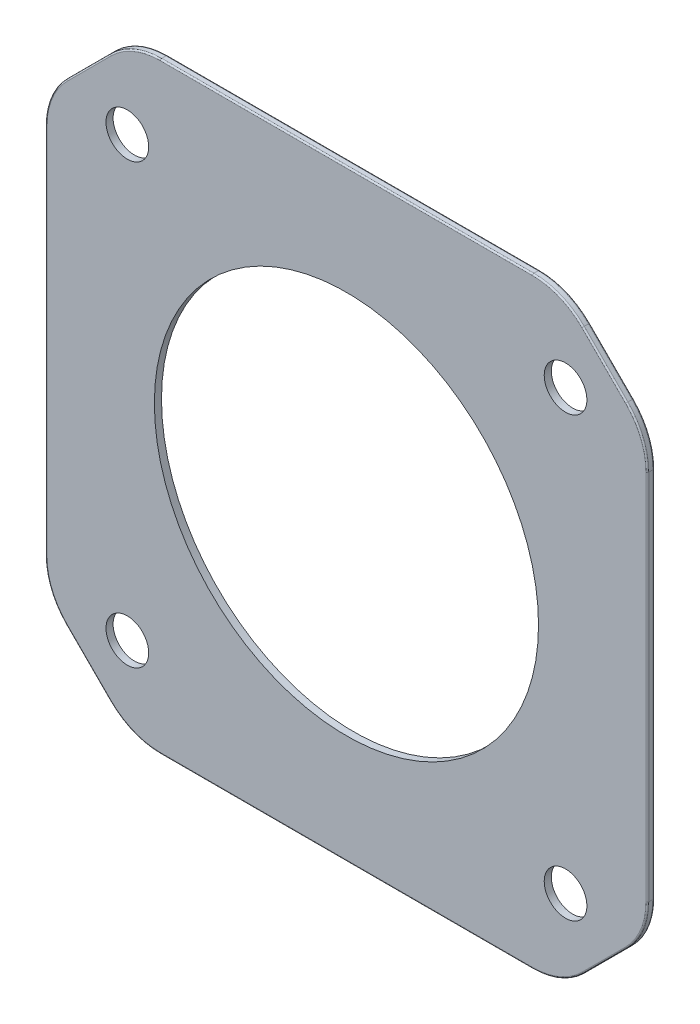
ISO-10303-21;
HEADER;
FILE_DESCRIPTION(('STEP AP214'),'2;1');
FILE_NAME('part.step','',(''),(''),'','','');
FILE_SCHEMA(('AUTOMOTIVE_DESIGN { 1 0 10303 214 1 1 1 1 }'));
ENDSEC;
DATA;
#1=APPLICATION_CONTEXT('core data for automotive mechanical design processes');
#2=APPLICATION_PROTOCOL_DEFINITION('international standard','automotive_design',2000,#1);
#3=PRODUCT_CONTEXT('',#1,'mechanical');
#4=PRODUCT('Part','Part','',(#3));
#5=PRODUCT_RELATED_PRODUCT_CATEGORY('part','',(#4));
#6=PRODUCT_DEFINITION_FORMATION('','',#4);
#7=PRODUCT_DEFINITION_CONTEXT('part definition',#1,'design');
#8=PRODUCT_DEFINITION('design','',#6,#7);
#9=PRODUCT_DEFINITION_SHAPE('','',#8);
#10=(LENGTH_UNIT() NAMED_UNIT(*) SI_UNIT(.MILLI.,.METRE.));
#11=(NAMED_UNIT(*) PLANE_ANGLE_UNIT() SI_UNIT($,.RADIAN.));
#12=(NAMED_UNIT(*) SI_UNIT($,.STERADIAN.) SOLID_ANGLE_UNIT());
#13=UNCERTAINTY_MEASURE_WITH_UNIT(LENGTH_MEASURE(1.E-05),#10,'distance_accuracy_value','');
#14=(GEOMETRIC_REPRESENTATION_CONTEXT(3) GLOBAL_UNCERTAINTY_ASSIGNED_CONTEXT((#13)) GLOBAL_UNIT_ASSIGNED_CONTEXT((#10,
#11,#12)) REPRESENTATION_CONTEXT('',''));
#15=CARTESIAN_POINT('',(0.,0.,0.));
#16=DIRECTION('',(0.,0.,1.));
#17=DIRECTION('',(1.,0.,0.));
#18=AXIS2_PLACEMENT_3D('',#15,#16,#17);
#19=CARTESIAN_POINT('',(3.07071067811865,39.2292893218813,2.62222222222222));
#20=DIRECTION('',(0.707106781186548,0.707106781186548,0.));
#21=DIRECTION('',(-0.707106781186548,0.707106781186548,0.));
#22=AXIS2_PLACEMENT_3D('',#19,#20,#21);
#23=CYLINDRICAL_SURFACE('',#22,0.100000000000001);
#24=DIRECTION('',(-0.707106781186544,-0.707106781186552,0.));
#25=VECTOR('',#24,1.);
#26=CARTESIAN_POINT('',(4.60624458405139,40.7648232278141,2.72222222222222));
#27=LINE('',#26,#25);
#28=CARTESIAN_POINT('',(4.60624458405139,40.7648232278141,2.72222222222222));
#29=VERTEX_POINT('',#28);
#30=CARTESIAN_POINT('',(1.53517677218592,37.6937554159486,2.72222222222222));
#31=VERTEX_POINT('',#30);
#32=EDGE_CURVE('E484',#29,#31,#27,.T.);
#33=ORIENTED_EDGE('',*,*,#32,.F.);
#34=CARTESIAN_POINT('',(4.6062445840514,40.7648232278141,2.62222222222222));
#35=DIRECTION('',(0.707106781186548,0.707106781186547,0.));
#36=DIRECTION('',(-0.707106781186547,0.707106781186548,0.));
#37=AXIS2_PLACEMENT_3D('',#34,#35,#36);
#38=CIRCLE('',#37,0.1);
#39=CARTESIAN_POINT('',(4.53553390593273,40.8355339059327,2.62222222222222));
#40=VERTEX_POINT('',#39);
#41=EDGE_CURVE('E220',#40,#29,#38,.T.);
#42=ORIENTED_EDGE('',*,*,#41,.F.);
#43=DIRECTION('',(-0.707106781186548,-0.707106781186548,0.));
#44=VECTOR('',#43,1.);
#45=CARTESIAN_POINT('',(3.,39.3,2.62222222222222));
#46=LINE('',#45,#44);
#47=CARTESIAN_POINT('',(1.46446609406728,37.7644660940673,2.62222222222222));
#48=VERTEX_POINT('',#47);
#49=EDGE_CURVE('E245',#48,#40,#46,.F.);
#50=ORIENTED_EDGE('',*,*,#49,.F.);
#51=CARTESIAN_POINT('',(1.53517677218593,37.6937554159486,2.62222222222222));
#52=DIRECTION('',(0.70710678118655,0.707106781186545,0.));
#53=DIRECTION('',(-0.707106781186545,0.70710678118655,0.));
#54=AXIS2_PLACEMENT_3D('',#51,#52,#53);
#55=CIRCLE('',#54,0.1);
#56=EDGE_CURVE('E227',#31,#48,#55,.F.);
#57=ORIENTED_EDGE('',*,*,#56,.F.);
#58=EDGE_LOOP('',(#33,#42,#50,#57));
#59=FACE_BOUND('',#58,.T.);
#60=ADVANCED_FACE('F17',(#59),#23,.T.);
#61=CARTESIAN_POINT('',(0.1,21.15,2.62222222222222));
#62=DIRECTION('',(0.,-1.,0.));
#63=DIRECTION('',(0.,0.,-1.));
#64=AXIS2_PLACEMENT_3D('',#61,#62,#63);
#65=CYLINDRICAL_SURFACE('',#64,0.0999999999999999);
#66=CARTESIAN_POINT('',(0.1,8.07106781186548,2.62222222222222));
#67=DIRECTION('',(0.,1.,0.));
#68=DIRECTION('',(-1.,0.,0.));
#69=AXIS2_PLACEMENT_3D('',#66,#67,#68);
#70=CIRCLE('',#69,0.1);
#71=CARTESIAN_POINT('',(0.0999999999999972,8.07106781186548,2.72222222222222));
#72=VERTEX_POINT('',#71);
#73=CARTESIAN_POINT('',(0.,8.07106781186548,2.62222222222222));
#74=VERTEX_POINT('',#73);
#75=EDGE_CURVE('E815',#72,#74,#70,.F.);
#76=ORIENTED_EDGE('',*,*,#75,.F.);
#77=DIRECTION('',(0.,1.,0.));
#78=VECTOR('',#77,1.);
#79=CARTESIAN_POINT('',(0.0999999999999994,21.15,2.72222222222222));
#80=LINE('',#79,#78);
#81=CARTESIAN_POINT('',(0.0999999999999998,34.2289321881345,2.72222222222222));
#82=VERTEX_POINT('',#81);
#83=EDGE_CURVE('E480',#82,#72,#80,.F.);
#84=ORIENTED_EDGE('',*,*,#83,.F.);
#85=CARTESIAN_POINT('',(0.1,34.2289321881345,2.62222222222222));
#86=DIRECTION('',(0.,1.,0.));
#87=DIRECTION('',(-1.,0.,0.));
#88=AXIS2_PLACEMENT_3D('',#85,#86,#87);
#89=CIRCLE('',#88,0.1);
#90=CARTESIAN_POINT('',(0.,34.2289321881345,2.62222222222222));
#91=VERTEX_POINT('',#90);
#92=EDGE_CURVE('E236',#91,#82,#89,.T.);
#93=ORIENTED_EDGE('',*,*,#92,.F.);
#94=DIRECTION('',(0.,1.,0.));
#95=VECTOR('',#94,1.);
#96=CARTESIAN_POINT('',(0.,21.15,2.62222222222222));
#97=LINE('',#96,#95);
#98=EDGE_CURVE('E726',#91,#74,#97,.F.);
#99=ORIENTED_EDGE('',*,*,#98,.T.);
#100=EDGE_LOOP('',(#76,#84,#93,#99));
#101=FACE_BOUND('',#100,.T.);
#102=ADVANCED_FACE('F1624',(#101),#65,.T.);
#103=CARTESIAN_POINT('',(3.07071067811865,3.07071067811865,2.62222222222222));
#104=DIRECTION('',(-0.707106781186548,0.707106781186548,0.));
#105=DIRECTION('',(-0.707106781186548,-0.707106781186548,0.));
#106=AXIS2_PLACEMENT_3D('',#103,#104,#105);
#107=CYLINDRICAL_SURFACE('',#106,0.1);
#108=DIRECTION('',(0.70710678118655,-0.707106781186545,0.));
#109=VECTOR('',#108,1.);
#110=CARTESIAN_POINT('',(1.53517677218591,4.60624458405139,2.72222222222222));
#111=LINE('',#110,#109);
#112=CARTESIAN_POINT('',(1.53517677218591,4.60624458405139,2.72222222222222));
#113=VERTEX_POINT('',#112);
#114=CARTESIAN_POINT('',(4.6062445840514,1.53517677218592,2.72222222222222));
#115=VERTEX_POINT('',#114);
#116=EDGE_CURVE('E475',#113,#115,#111,.T.);
#117=ORIENTED_EDGE('',*,*,#116,.F.);
#118=CARTESIAN_POINT('',(1.53517677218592,4.6062445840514,2.62222222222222));
#119=DIRECTION('',(-0.707106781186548,0.707106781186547,0.));
#120=DIRECTION('',(-0.707106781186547,-0.707106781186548,0.));
#121=AXIS2_PLACEMENT_3D('',#118,#119,#120);
#122=CIRCLE('',#121,0.1);
#123=CARTESIAN_POINT('',(1.46446609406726,4.53553390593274,2.62222222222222));
#124=VERTEX_POINT('',#123);
#125=EDGE_CURVE('E695',#124,#113,#122,.T.);
#126=ORIENTED_EDGE('',*,*,#125,.F.);
#127=DIRECTION('',(0.707106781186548,-0.707106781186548,0.));
#128=VECTOR('',#127,1.);
#129=CARTESIAN_POINT('',(3.,3.,2.62222222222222));
#130=LINE('',#129,#128);
#131=CARTESIAN_POINT('',(4.53553390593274,1.46446609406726,2.62222222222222));
#132=VERTEX_POINT('',#131);
#133=EDGE_CURVE('E714',#132,#124,#130,.F.);
#134=ORIENTED_EDGE('',*,*,#133,.F.);
#135=CARTESIAN_POINT('',(4.6062445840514,1.53517677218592,2.62222222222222));
#136=DIRECTION('',(-0.707106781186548,0.707106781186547,0.));
#137=DIRECTION('',(-0.707106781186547,-0.707106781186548,0.));
#138=AXIS2_PLACEMENT_3D('',#135,#136,#137);
#139=CIRCLE('',#138,0.1);
#140=EDGE_CURVE('E681',#115,#132,#139,.F.);
#141=ORIENTED_EDGE('',*,*,#140,.F.);
#142=EDGE_LOOP('',(#117,#126,#134,#141));
#143=FACE_BOUND('',#142,.T.);
#144=ADVANCED_FACE('F825',(#143),#107,.T.);
#145=CARTESIAN_POINT('',(21.15,0.1,2.62222222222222));
#146=DIRECTION('',(1.,0.,0.));
#147=DIRECTION('',(0.,0.,-1.));
#148=AXIS2_PLACEMENT_3D('',#145,#146,#147);
#149=CYLINDRICAL_SURFACE('',#148,0.1);
#150=CARTESIAN_POINT('',(34.2289321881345,0.0999999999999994,2.62222222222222));
#151=DIRECTION('',(-1.,0.,0.));
#152=DIRECTION('',(0.,-1.,0.));
#153=AXIS2_PLACEMENT_3D('',#150,#151,#152);
#154=CIRCLE('',#153,0.1);
#155=CARTESIAN_POINT('',(34.2289321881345,0.0999999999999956,2.72222222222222));
#156=VERTEX_POINT('',#155);
#157=CARTESIAN_POINT('',(34.2289321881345,0.,2.62222222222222));
#158=VERTEX_POINT('',#157);
#159=EDGE_CURVE('E832',#156,#158,#154,.F.);
#160=ORIENTED_EDGE('',*,*,#159,.F.);
#161=DIRECTION('',(1.,0.,0.));
#162=VECTOR('',#161,1.);
#163=CARTESIAN_POINT('',(21.15,0.0999999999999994,2.72222222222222));
#164=LINE('',#163,#162);
#165=CARTESIAN_POINT('',(8.07106781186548,0.0999999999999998,2.72222222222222));
#166=VERTEX_POINT('',#165);
#167=EDGE_CURVE('E470',#166,#156,#164,.T.);
#168=ORIENTED_EDGE('',*,*,#167,.F.);
#169=CARTESIAN_POINT('',(8.07106781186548,0.1,2.62222222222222));
#170=DIRECTION('',(-1.,0.,0.));
#171=DIRECTION('',(0.,-1.,0.));
#172=AXIS2_PLACEMENT_3D('',#169,#170,#171);
#173=CIRCLE('',#172,0.1);
#174=CARTESIAN_POINT('',(8.07106781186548,0.,2.62222222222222));
#175=VERTEX_POINT('',#174);
#176=EDGE_CURVE('E648',#175,#166,#173,.T.);
#177=ORIENTED_EDGE('',*,*,#176,.F.);
#178=DIRECTION('',(1.,0.,0.));
#179=VECTOR('',#178,1.);
#180=CARTESIAN_POINT('',(21.15,0.,2.62222222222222));
#181=LINE('',#180,#179);
#182=EDGE_CURVE('E647',#175,#158,#181,.T.);
#183=ORIENTED_EDGE('',*,*,#182,.T.);
#184=EDGE_LOOP('',(#160,#168,#177,#183));
#185=FACE_BOUND('',#184,.T.);
#186=ADVANCED_FACE('F830',(#185),#149,.T.);
#187=CARTESIAN_POINT('',(39.2292893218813,3.07071067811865,2.62222222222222));
#188=DIRECTION('',(-0.707106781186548,-0.707106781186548,0.));
#189=DIRECTION('',(0.707106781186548,-0.707106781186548,0.));
#190=AXIS2_PLACEMENT_3D('',#187,#188,#189);
#191=CYLINDRICAL_SURFACE('',#190,0.100000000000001);
#192=DIRECTION('',(0.70710678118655,0.707106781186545,0.));
#193=VECTOR('',#192,1.);
#194=CARTESIAN_POINT('',(37.6937554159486,1.53517677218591,2.72222222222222));
#195=LINE('',#194,#193);
#196=CARTESIAN_POINT('',(37.6937554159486,1.53517677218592,2.72222222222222));
#197=VERTEX_POINT('',#196);
#198=CARTESIAN_POINT('',(40.7648232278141,4.60624458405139,2.72222222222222));
#199=VERTEX_POINT('',#198);
#200=EDGE_CURVE('E465',#197,#199,#195,.T.);
#201=ORIENTED_EDGE('',*,*,#200,.F.);
#202=CARTESIAN_POINT('',(37.6937554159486,1.53517677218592,2.62222222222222));
#203=DIRECTION('',(-0.707106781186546,-0.707106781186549,0.));
#204=DIRECTION('',(0.707106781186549,-0.707106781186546,0.));
#205=AXIS2_PLACEMENT_3D('',#202,#203,#204);
#206=CIRCLE('',#205,0.1);
#207=CARTESIAN_POINT('',(37.7644660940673,1.46446609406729,2.62222222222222));
#208=VERTEX_POINT('',#207);
#209=EDGE_CURVE('E614',#208,#197,#206,.T.);
#210=ORIENTED_EDGE('',*,*,#209,.F.);
#211=DIRECTION('',(0.707106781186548,0.707106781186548,0.));
#212=VECTOR('',#211,1.);
#213=CARTESIAN_POINT('',(39.3,3.,2.62222222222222));
#214=LINE('',#213,#212);
#215=CARTESIAN_POINT('',(40.8355339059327,4.53553390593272,2.62222222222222));
#216=VERTEX_POINT('',#215);
#217=EDGE_CURVE('E633',#216,#208,#214,.F.);
#218=ORIENTED_EDGE('',*,*,#217,.F.);
#219=CARTESIAN_POINT('',(40.7648232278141,4.6062445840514,2.62222222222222));
#220=DIRECTION('',(-0.707106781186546,-0.707106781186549,0.));
#221=DIRECTION('',(0.707106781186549,-0.707106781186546,0.));
#222=AXIS2_PLACEMENT_3D('',#219,#220,#221);
#223=CIRCLE('',#222,0.1);
#224=EDGE_CURVE('E600',#199,#216,#223,.F.);
#225=ORIENTED_EDGE('',*,*,#224,.F.);
#226=EDGE_LOOP('',(#201,#210,#218,#225));
#227=FACE_BOUND('',#226,.T.);
#228=ADVANCED_FACE('F843',(#227),#191,.T.);
#229=CARTESIAN_POINT('',(42.2,21.15,2.62222222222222));
#230=DIRECTION('',(0.,1.,0.));
#231=DIRECTION('',(0.,0.,1.));
#232=AXIS2_PLACEMENT_3D('',#229,#230,#231);
#233=CYLINDRICAL_SURFACE('',#232,0.0999999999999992);
#234=CARTESIAN_POINT('',(42.2,34.2289321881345,2.62222222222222));
#235=DIRECTION('',(0.,-1.,0.));
#236=DIRECTION('',(1.,0.,0.));
#237=AXIS2_PLACEMENT_3D('',#234,#235,#236);
#238=CIRCLE('',#237,0.1);
#239=CARTESIAN_POINT('',(42.2,34.2289321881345,2.72222222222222));
#240=VERTEX_POINT('',#239);
#241=CARTESIAN_POINT('',(42.3,34.2289321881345,2.62222222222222));
#242=VERTEX_POINT('',#241);
#243=EDGE_CURVE('E851',#240,#242,#238,.F.);
#244=ORIENTED_EDGE('',*,*,#243,.F.);
#245=DIRECTION('',(0.,1.,0.));
#246=VECTOR('',#245,1.);
#247=CARTESIAN_POINT('',(42.2,21.15,2.72222222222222));
#248=LINE('',#247,#246);
#249=CARTESIAN_POINT('',(42.2,8.07106781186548,2.72222222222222));
#250=VERTEX_POINT('',#249);
#251=EDGE_CURVE('E460',#250,#240,#248,.T.);
#252=ORIENTED_EDGE('',*,*,#251,.F.);
#253=CARTESIAN_POINT('',(42.2,8.07106781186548,2.62222222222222));
#254=DIRECTION('',(0.,-1.,0.));
#255=DIRECTION('',(1.,0.,0.));
#256=AXIS2_PLACEMENT_3D('',#253,#254,#255);
#257=CIRCLE('',#256,0.1);
#258=CARTESIAN_POINT('',(42.3,8.07106781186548,2.62222222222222));
#259=VERTEX_POINT('',#258);
#260=EDGE_CURVE('E567',#259,#250,#257,.T.);
#261=ORIENTED_EDGE('',*,*,#260,.F.);
#262=DIRECTION('',(0.,1.,0.));
#263=VECTOR('',#262,1.);
#264=CARTESIAN_POINT('',(42.3,21.15,2.62222222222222));
#265=LINE('',#264,#263);
#266=EDGE_CURVE('E566',#259,#242,#265,.T.);
#267=ORIENTED_EDGE('',*,*,#266,.T.);
#268=EDGE_LOOP('',(#244,#252,#261,#267));
#269=FACE_BOUND('',#268,.T.);
#270=ADVANCED_FACE('F849',(#269),#233,.T.);
#271=CARTESIAN_POINT('',(39.2292893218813,39.2292893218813,2.62222222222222));
#272=DIRECTION('',(0.707106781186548,-0.707106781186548,0.));
#273=DIRECTION('',(0.707106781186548,0.707106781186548,0.));
#274=AXIS2_PLACEMENT_3D('',#271,#272,#273);
#275=CYLINDRICAL_SURFACE('',#274,0.100000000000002);
#276=DIRECTION('',(-0.707106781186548,0.707106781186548,0.));
#277=VECTOR('',#276,1.);
#278=CARTESIAN_POINT('',(40.7648232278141,37.6937554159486,2.72222222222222));
#279=LINE('',#278,#277);
#280=CARTESIAN_POINT('',(40.7648232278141,37.6937554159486,2.72222222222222));
#281=VERTEX_POINT('',#280);
#282=CARTESIAN_POINT('',(37.6937554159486,40.7648232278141,2.72222222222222));
#283=VERTEX_POINT('',#282);
#284=EDGE_CURVE('E444',#281,#283,#279,.T.);
#285=ORIENTED_EDGE('',*,*,#284,.F.);
#286=CARTESIAN_POINT('',(40.7648232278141,37.6937554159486,2.62222222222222));
#287=DIRECTION('',(0.707106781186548,-0.707106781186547,0.));
#288=DIRECTION('',(0.707106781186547,0.707106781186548,0.));
#289=AXIS2_PLACEMENT_3D('',#286,#287,#288);
#290=CIRCLE('',#289,0.1);
#291=CARTESIAN_POINT('',(40.8355339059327,37.7644660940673,2.62222222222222));
#292=VERTEX_POINT('',#291);
#293=EDGE_CURVE('E532',#292,#281,#290,.T.);
#294=ORIENTED_EDGE('',*,*,#293,.F.);
#295=DIRECTION('',(-0.707106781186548,0.707106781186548,0.));
#296=VECTOR('',#295,1.);
#297=CARTESIAN_POINT('',(39.3,39.3,2.62222222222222));
#298=LINE('',#297,#296);
#299=CARTESIAN_POINT('',(37.7644660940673,40.8355339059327,2.62222222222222));
#300=VERTEX_POINT('',#299);
#301=EDGE_CURVE('E551',#300,#292,#298,.F.);
#302=ORIENTED_EDGE('',*,*,#301,.F.);
#303=CARTESIAN_POINT('',(37.6937554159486,40.7648232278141,2.62222222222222));
#304=DIRECTION('',(0.707106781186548,-0.707106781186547,0.));
#305=DIRECTION('',(0.707106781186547,0.707106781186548,0.));
#306=AXIS2_PLACEMENT_3D('',#303,#304,#305);
#307=CIRCLE('',#306,0.1);
#308=EDGE_CURVE('E520',#283,#300,#307,.F.);
#309=ORIENTED_EDGE('',*,*,#308,.F.);
#310=EDGE_LOOP('',(#285,#294,#302,#309));
#311=FACE_BOUND('',#310,.T.);
#312=ADVANCED_FACE('F860',(#311),#275,.T.);
#313=CARTESIAN_POINT('',(21.15,42.2,2.62222222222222));
#314=DIRECTION('',(-1.,0.,0.));
#315=DIRECTION('',(0.,0.,1.));
#316=AXIS2_PLACEMENT_3D('',#313,#314,#315);
#317=CYLINDRICAL_SURFACE('',#316,0.0999999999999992);
#318=CARTESIAN_POINT('',(8.07106781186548,42.2,2.62222222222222));
#319=DIRECTION('',(1.,0.,0.));
#320=DIRECTION('',(0.,1.,0.));
#321=AXIS2_PLACEMENT_3D('',#318,#319,#320);
#322=CIRCLE('',#321,0.1);
#323=CARTESIAN_POINT('',(8.07106781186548,42.2,2.72222222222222));
#324=VERTEX_POINT('',#323);
#325=CARTESIAN_POINT('',(8.07106781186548,42.3,2.62222222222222));
#326=VERTEX_POINT('',#325);
#327=EDGE_CURVE('E452',#324,#326,#322,.F.);
#328=ORIENTED_EDGE('',*,*,#327,.F.);
#329=DIRECTION('',(1.,0.,0.));
#330=VECTOR('',#329,1.);
#331=CARTESIAN_POINT('',(21.15,42.2,2.72222222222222));
#332=LINE('',#331,#330);
#333=CARTESIAN_POINT('',(34.2289321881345,42.2,2.72222222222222));
#334=VERTEX_POINT('',#333);
#335=EDGE_CURVE('E443',#334,#324,#332,.F.);
#336=ORIENTED_EDGE('',*,*,#335,.F.);
#337=CARTESIAN_POINT('',(34.2289321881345,42.2,2.62222222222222));
#338=DIRECTION('',(1.,0.,0.));
#339=DIRECTION('',(0.,1.,0.));
#340=AXIS2_PLACEMENT_3D('',#337,#338,#339);
#341=CIRCLE('',#340,0.1);
#342=CARTESIAN_POINT('',(34.2289321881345,42.3,2.62222222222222));
#343=VERTEX_POINT('',#342);
#344=EDGE_CURVE('E450',#343,#334,#341,.T.);
#345=ORIENTED_EDGE('',*,*,#344,.F.);
#346=DIRECTION('',(1.,0.,0.));
#347=VECTOR('',#346,1.);
#348=CARTESIAN_POINT('',(21.15,42.3,2.62222222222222));
#349=LINE('',#348,#347);
#350=EDGE_CURVE('E491',#343,#326,#349,.F.);
#351=ORIENTED_EDGE('',*,*,#350,.T.);
#352=EDGE_LOOP('',(#328,#336,#345,#351));
#353=FACE_BOUND('',#352,.T.);
#354=ADVANCED_FACE('F449',(#353),#317,.T.);
#355=CARTESIAN_POINT('',(3.,39.3,2.47222222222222));
#356=DIRECTION('',(-0.707106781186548,0.707106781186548,0.));
#357=DIRECTION('',(-0.707106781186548,-0.707106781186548,0.));
#358=AXIS2_PLACEMENT_3D('',#355,#356,#357);
#359=PLANE('',#358);
#360=DIRECTION('',(-0.707106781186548,-0.707106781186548,0.));
#361=VECTOR('',#360,1.);
#362=CARTESIAN_POINT('',(2.99999999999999,39.3,2.32222222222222));
#363=LINE('',#362,#361);
#364=CARTESIAN_POINT('',(1.46446609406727,37.7644660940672,2.32222222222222));
#365=VERTEX_POINT('',#364);
#366=CARTESIAN_POINT('',(4.53553390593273,40.8355339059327,2.32222222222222));
#367=VERTEX_POINT('',#366);
#368=EDGE_CURVE('E248',#365,#367,#363,.F.);
#369=ORIENTED_EDGE('',*,*,#368,.F.);
#370=DIRECTION('',(0.,0.,1.));
#371=VECTOR('',#370,1.);
#372=CARTESIAN_POINT('',(1.46446609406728,37.7644660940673,2.47222222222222));
#373=LINE('',#372,#371);
#374=EDGE_CURVE('E237',#365,#48,#373,.T.);
#375=ORIENTED_EDGE('',*,*,#374,.T.);
#376=ORIENTED_EDGE('',*,*,#49,.T.);
#377=DIRECTION('',(0.,0.,1.));
#378=VECTOR('',#377,1.);
#379=CARTESIAN_POINT('',(4.53553390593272,40.8355339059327,2.47222222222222));
#380=LINE('',#379,#378);
#381=EDGE_CURVE('E250',#40,#367,#380,.F.);
#382=ORIENTED_EDGE('',*,*,#381,.T.);
#383=EDGE_LOOP('',(#369,#375,#376,#382));
#384=FACE_BOUND('',#383,.T.);
#385=ADVANCED_FACE('F243',(#384),#359,.T.);
#386=CARTESIAN_POINT('',(5.,34.2289321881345,2.62222222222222));
#387=DIRECTION('',(0.,0.,-1.));
#388=DIRECTION('',(-1.,0.,0.));
#389=AXIS2_PLACEMENT_3D('',#386,#387,#388);
#390=TOROIDAL_SURFACE('',#389,4.9,0.1);
#391=ORIENTED_EDGE('',*,*,#92,.T.);
#392=CARTESIAN_POINT('',(5.,34.2289321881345,2.72222222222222));
#393=DIRECTION('',(0.,0.,-1.));
#394=DIRECTION('',(-1.,0.,0.));
#395=AXIS2_PLACEMENT_3D('',#392,#393,#394);
#396=CIRCLE('',#395,4.9);
#397=EDGE_CURVE('E234',#31,#82,#396,.F.);
#398=ORIENTED_EDGE('',*,*,#397,.F.);
#399=ORIENTED_EDGE('',*,*,#56,.T.);
#400=CARTESIAN_POINT('',(5.,34.2289321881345,2.62222222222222));
#401=DIRECTION('',(0.,0.,-1.));
#402=DIRECTION('',(-1.,0.,0.));
#403=AXIS2_PLACEMENT_3D('',#400,#401,#402);
#404=CIRCLE('',#403,5.);
#405=EDGE_CURVE('E231',#91,#48,#404,.T.);
#406=ORIENTED_EDGE('',*,*,#405,.F.);
#407=EDGE_LOOP('',(#391,#398,#399,#406));
#408=FACE_BOUND('',#407,.T.);
#409=ADVANCED_FACE('F229',(#408),#390,.T.);
#410=CARTESIAN_POINT('',(0.,21.15,32.4722222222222));
#411=DIRECTION('',(1.,0.,0.));
#412=DIRECTION('',(0.,0.,-1.));
#413=AXIS2_PLACEMENT_3D('',#410,#411,#412);
#414=PLANE('',#413);
#415=DIRECTION('',(0.,0.,-1.));
#416=VECTOR('',#415,1.);
#417=CARTESIAN_POINT('',(0.,34.2289321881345,17.4722222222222));
#418=LINE('',#417,#416);
#419=CARTESIAN_POINT('',(0.,34.2289321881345,2.32222222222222));
#420=VERTEX_POINT('',#419);
#421=EDGE_CURVE('E255',#420,#91,#418,.F.);
#422=ORIENTED_EDGE('',*,*,#421,.F.);
#423=DIRECTION('',(0.,1.,0.));
#424=VECTOR('',#423,1.);
#425=CARTESIAN_POINT('',(0.,21.15,2.32222222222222));
#426=LINE('',#425,#424);
#427=CARTESIAN_POINT('',(0.,8.07106781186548,2.32222222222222));
#428=VERTEX_POINT('',#427);
#429=EDGE_CURVE('E256',#428,#420,#426,.T.);
#430=ORIENTED_EDGE('',*,*,#429,.F.);
#431=DIRECTION('',(0.,0.,-1.));
#432=VECTOR('',#431,1.);
#433=CARTESIAN_POINT('',(0.,8.07106781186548,32.4722222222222));
#434=LINE('',#433,#432);
#435=EDGE_CURVE('E723',#74,#428,#434,.T.);
#436=ORIENTED_EDGE('',*,*,#435,.F.);
#437=ORIENTED_EDGE('',*,*,#98,.F.);
#438=EDGE_LOOP('',(#422,#430,#436,#437));
#439=FACE_BOUND('',#438,.T.);
#440=ADVANCED_FACE('F707',(#439),#414,.F.);
#441=CARTESIAN_POINT('',(5.,8.07106781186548,2.62222222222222));
#442=DIRECTION('',(0.,0.,-1.));
#443=DIRECTION('',(-1.,0.,0.));
#444=AXIS2_PLACEMENT_3D('',#441,#442,#443);
#445=TOROIDAL_SURFACE('',#444,4.9,0.1);
#446=ORIENTED_EDGE('',*,*,#125,.T.);
#447=CARTESIAN_POINT('',(5.,8.07106781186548,2.72222222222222));
#448=DIRECTION('',(0.,0.,-1.));
#449=DIRECTION('',(-0.707106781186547,-0.707106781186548,0.));
#450=AXIS2_PLACEMENT_3D('',#447,#448,#449);
#451=CIRCLE('',#450,4.9);
#452=EDGE_CURVE('E477',#72,#113,#451,.F.);
#453=ORIENTED_EDGE('',*,*,#452,.F.);
#454=ORIENTED_EDGE('',*,*,#75,.T.);
#455=CARTESIAN_POINT('',(5.,8.07106781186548,2.62222222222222));
#456=DIRECTION('',(0.,0.,-1.));
#457=DIRECTION('',(-1.,0.,0.));
#458=AXIS2_PLACEMENT_3D('',#455,#456,#457);
#459=CIRCLE('',#458,5.);
#460=EDGE_CURVE('E342',#124,#74,#459,.T.);
#461=ORIENTED_EDGE('',*,*,#460,.F.);
#462=EDGE_LOOP('',(#446,#453,#454,#461));
#463=FACE_BOUND('',#462,.T.);
#464=ADVANCED_FACE('F697',(#463),#445,.T.);
#465=CARTESIAN_POINT('',(3.,3.,2.47222222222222));
#466=DIRECTION('',(-0.707106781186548,-0.707106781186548,0.));
#467=DIRECTION('',(0.707106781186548,-0.707106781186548,0.));
#468=AXIS2_PLACEMENT_3D('',#465,#466,#467);
#469=PLANE('',#468);
#470=DIRECTION('',(0.707106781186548,-0.707106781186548,0.));
#471=VECTOR('',#470,1.);
#472=CARTESIAN_POINT('',(2.99999999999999,2.99999999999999,2.32222222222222));
#473=LINE('',#472,#471);
#474=CARTESIAN_POINT('',(4.53553390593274,1.46446609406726,2.32222222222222));
#475=VERTEX_POINT('',#474);
#476=CARTESIAN_POINT('',(1.46446609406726,4.53553390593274,2.32222222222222));
#477=VERTEX_POINT('',#476);
#478=EDGE_CURVE('E338',#475,#477,#473,.F.);
#479=ORIENTED_EDGE('',*,*,#478,.F.);
#480=DIRECTION('',(0.,0.,1.));
#481=VECTOR('',#480,1.);
#482=CARTESIAN_POINT('',(4.53553390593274,1.46446609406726,2.47222222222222));
#483=LINE('',#482,#481);
#484=EDGE_CURVE('E685',#475,#132,#483,.T.);
#485=ORIENTED_EDGE('',*,*,#484,.T.);
#486=ORIENTED_EDGE('',*,*,#133,.T.);
#487=DIRECTION('',(0.,0.,-1.));
#488=VECTOR('',#487,1.);
#489=CARTESIAN_POINT('',(1.46446609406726,4.53553390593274,17.4722222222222));
#490=LINE('',#489,#488);
#491=EDGE_CURVE('E351',#477,#124,#490,.F.);
#492=ORIENTED_EDGE('',*,*,#491,.F.);
#493=EDGE_LOOP('',(#479,#485,#486,#492));
#494=FACE_BOUND('',#493,.T.);
#495=ADVANCED_FACE('F665',(#494),#469,.T.);
#496=CARTESIAN_POINT('',(8.07106781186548,5.,2.62222222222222));
#497=DIRECTION('',(0.,0.,-1.));
#498=DIRECTION('',(-1.,0.,0.));
#499=AXIS2_PLACEMENT_3D('',#496,#497,#498);
#500=TOROIDAL_SURFACE('',#499,4.9,0.1);
#501=ORIENTED_EDGE('',*,*,#176,.T.);
#502=CARTESIAN_POINT('',(8.07106781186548,5.,2.72222222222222));
#503=DIRECTION('',(0.,0.,-1.));
#504=DIRECTION('',(0.,-1.,0.));
#505=AXIS2_PLACEMENT_3D('',#502,#503,#504);
#506=CIRCLE('',#505,4.9);
#507=EDGE_CURVE('E472',#115,#166,#506,.F.);
#508=ORIENTED_EDGE('',*,*,#507,.F.);
#509=ORIENTED_EDGE('',*,*,#140,.T.);
#510=CARTESIAN_POINT('',(8.07106781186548,5.,2.62222222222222));
#511=DIRECTION('',(0.,0.,1.));
#512=DIRECTION('',(1.,0.,0.));
#513=AXIS2_PLACEMENT_3D('',#510,#511,#512);
#514=CIRCLE('',#513,5.);
#515=EDGE_CURVE('E326',#175,#132,#514,.F.);
#516=ORIENTED_EDGE('',*,*,#515,.F.);
#517=EDGE_LOOP('',(#501,#508,#509,#516));
#518=FACE_BOUND('',#517,.T.);
#519=ADVANCED_FACE('F661',(#518),#500,.T.);
#520=CARTESIAN_POINT('',(21.15,0.,2.47222222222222));
#521=DIRECTION('',(0.,1.,0.));
#522=DIRECTION('',(0.,0.,1.));
#523=AXIS2_PLACEMENT_3D('',#520,#521,#522);
#524=PLANE('',#523);
#525=DIRECTION('',(0.,0.,1.));
#526=VECTOR('',#525,1.);
#527=CARTESIAN_POINT('',(8.07106781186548,0.,2.47222222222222));
#528=LINE('',#527,#526);
#529=CARTESIAN_POINT('',(8.07106781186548,0.,2.32222222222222));
#530=VERTEX_POINT('',#529);
#531=EDGE_CURVE('E329',#530,#175,#528,.T.);
#532=ORIENTED_EDGE('',*,*,#531,.F.);
#533=DIRECTION('',(-1.,0.,0.));
#534=VECTOR('',#533,1.);
#535=CARTESIAN_POINT('',(21.15,0.,2.32222222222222));
#536=LINE('',#535,#534);
#537=CARTESIAN_POINT('',(34.2289321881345,0.,2.32222222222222));
#538=VERTEX_POINT('',#537);
#539=EDGE_CURVE('E328',#538,#530,#536,.T.);
#540=ORIENTED_EDGE('',*,*,#539,.F.);
#541=DIRECTION('',(0.,0.,1.));
#542=VECTOR('',#541,1.);
#543=CARTESIAN_POINT('',(34.2289321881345,0.,2.47222222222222));
#544=LINE('',#543,#542);
#545=EDGE_CURVE('E644',#158,#538,#544,.F.);
#546=ORIENTED_EDGE('',*,*,#545,.F.);
#547=ORIENTED_EDGE('',*,*,#182,.F.);
#548=EDGE_LOOP('',(#532,#540,#546,#547));
#549=FACE_BOUND('',#548,.T.);
#550=ADVANCED_FACE('F626',(#549),#524,.F.);
#551=CARTESIAN_POINT('',(34.2289321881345,5.,2.62222222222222));
#552=DIRECTION('',(0.,0.,-1.));
#553=DIRECTION('',(-1.,0.,0.));
#554=AXIS2_PLACEMENT_3D('',#551,#552,#553);
#555=TOROIDAL_SURFACE('',#554,4.9,0.1);
#556=ORIENTED_EDGE('',*,*,#209,.T.);
#557=CARTESIAN_POINT('',(34.2289321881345,5.,2.72222222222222));
#558=DIRECTION('',(0.,0.,-1.));
#559=DIRECTION('',(0.707106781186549,-0.707106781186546,0.));
#560=AXIS2_PLACEMENT_3D('',#557,#558,#559);
#561=CIRCLE('',#560,4.90000000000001);
#562=EDGE_CURVE('E467',#156,#197,#561,.F.);
#563=ORIENTED_EDGE('',*,*,#562,.F.);
#564=ORIENTED_EDGE('',*,*,#159,.T.);
#565=CARTESIAN_POINT('',(34.2289321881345,5.,2.62222222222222));
#566=DIRECTION('',(0.,0.,-1.));
#567=DIRECTION('',(-1.,0.,0.));
#568=AXIS2_PLACEMENT_3D('',#565,#566,#567);
#569=CIRCLE('',#568,5.);
#570=EDGE_CURVE('E638',#208,#158,#569,.T.);
#571=ORIENTED_EDGE('',*,*,#570,.F.);
#572=EDGE_LOOP('',(#556,#563,#564,#571));
#573=FACE_BOUND('',#572,.T.);
#574=ADVANCED_FACE('F616',(#573),#555,.T.);
#575=CARTESIAN_POINT('',(39.3,3.,2.47222222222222));
#576=DIRECTION('',(0.707106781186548,-0.707106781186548,0.));
#577=DIRECTION('',(0.707106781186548,0.707106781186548,0.));
#578=AXIS2_PLACEMENT_3D('',#575,#576,#577);
#579=PLANE('',#578);
#580=DIRECTION('',(0.707106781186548,0.707106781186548,0.));
#581=VECTOR('',#580,1.);
#582=CARTESIAN_POINT('',(39.3,2.99999999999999,2.32222222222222));
#583=LINE('',#582,#581);
#584=CARTESIAN_POINT('',(40.8355339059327,4.53553390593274,2.32222222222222));
#585=VERTEX_POINT('',#584);
#586=CARTESIAN_POINT('',(37.7644660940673,1.46446609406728,2.32222222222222));
#587=VERTEX_POINT('',#586);
#588=EDGE_CURVE('E641',#585,#587,#583,.F.);
#589=ORIENTED_EDGE('',*,*,#588,.F.);
#590=DIRECTION('',(0.,0.,1.));
#591=VECTOR('',#590,1.);
#592=CARTESIAN_POINT('',(40.8355339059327,4.53553390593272,2.47222222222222));
#593=LINE('',#592,#591);
#594=EDGE_CURVE('E604',#585,#216,#593,.T.);
#595=ORIENTED_EDGE('',*,*,#594,.T.);
#596=ORIENTED_EDGE('',*,*,#217,.T.);
#597=DIRECTION('',(0.,0.,-1.));
#598=VECTOR('',#597,1.);
#599=CARTESIAN_POINT('',(37.7644660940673,1.4644660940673,2.47222222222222));
#600=LINE('',#599,#598);
#601=EDGE_CURVE('E336',#587,#208,#600,.F.);
#602=ORIENTED_EDGE('',*,*,#601,.F.);
#603=EDGE_LOOP('',(#589,#595,#596,#602));
#604=FACE_BOUND('',#603,.T.);
#605=ADVANCED_FACE('F584',(#604),#579,.T.);
#606=CARTESIAN_POINT('',(37.3,8.07106781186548,2.62222222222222));
#607=DIRECTION('',(0.,0.,-1.));
#608=DIRECTION('',(-1.,0.,0.));
#609=AXIS2_PLACEMENT_3D('',#606,#607,#608);
#610=TOROIDAL_SURFACE('',#609,4.9,0.1);
#611=ORIENTED_EDGE('',*,*,#260,.T.);
#612=CARTESIAN_POINT('',(37.3,8.07106781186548,2.72222222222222));
#613=DIRECTION('',(0.,0.,-1.));
#614=DIRECTION('',(1.,0.,0.));
#615=AXIS2_PLACEMENT_3D('',#612,#613,#614);
#616=CIRCLE('',#615,4.9);
#617=EDGE_CURVE('E462',#199,#250,#616,.F.);
#618=ORIENTED_EDGE('',*,*,#617,.F.);
#619=ORIENTED_EDGE('',*,*,#224,.T.);
#620=CARTESIAN_POINT('',(37.3,8.07106781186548,2.62222222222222));
#621=DIRECTION('',(0.,0.,1.));
#622=DIRECTION('',(1.,0.,0.));
#623=AXIS2_PLACEMENT_3D('',#620,#621,#622);
#624=CIRCLE('',#623,5.);
#625=EDGE_CURVE('E320',#259,#216,#624,.F.);
#626=ORIENTED_EDGE('',*,*,#625,.F.);
#627=EDGE_LOOP('',(#611,#618,#619,#626));
#628=FACE_BOUND('',#627,.T.);
#629=ADVANCED_FACE('F580',(#628),#610,.T.);
#630=CARTESIAN_POINT('',(42.3,21.15,2.47222222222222));
#631=DIRECTION('',(-1.,0.,0.));
#632=DIRECTION('',(0.,0.,1.));
#633=AXIS2_PLACEMENT_3D('',#630,#631,#632);
#634=PLANE('',#633);
#635=DIRECTION('',(0.,0.,1.));
#636=VECTOR('',#635,1.);
#637=CARTESIAN_POINT('',(42.3,8.07106781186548,2.47222222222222));
#638=LINE('',#637,#636);
#639=CARTESIAN_POINT('',(42.3,8.07106781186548,2.32222222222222));
#640=VERTEX_POINT('',#639);
#641=EDGE_CURVE('E324',#640,#259,#638,.T.);
#642=ORIENTED_EDGE('',*,*,#641,.F.);
#643=DIRECTION('',(0.,-1.,0.));
#644=VECTOR('',#643,1.);
#645=CARTESIAN_POINT('',(42.3,21.15,2.32222222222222));
#646=LINE('',#645,#644);
#647=CARTESIAN_POINT('',(42.3,34.2289321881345,2.32222222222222));
#648=VERTEX_POINT('',#647);
#649=EDGE_CURVE('E323',#648,#640,#646,.T.);
#650=ORIENTED_EDGE('',*,*,#649,.F.);
#651=DIRECTION('',(0.,0.,1.));
#652=VECTOR('',#651,1.);
#653=CARTESIAN_POINT('',(42.3,34.2289321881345,2.47222222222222));
#654=LINE('',#653,#652);
#655=EDGE_CURVE('E563',#242,#648,#654,.F.);
#656=ORIENTED_EDGE('',*,*,#655,.F.);
#657=ORIENTED_EDGE('',*,*,#266,.F.);
#658=EDGE_LOOP('',(#642,#650,#656,#657));
#659=FACE_BOUND('',#658,.T.);
#660=ADVANCED_FACE('F544',(#659),#634,.F.);
#661=CARTESIAN_POINT('',(37.3,34.2289321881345,2.62222222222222));
#662=DIRECTION('',(0.,0.,-1.));
#663=DIRECTION('',(-1.,0.,0.));
#664=AXIS2_PLACEMENT_3D('',#661,#662,#663);
#665=TOROIDAL_SURFACE('',#664,4.9,0.1);
#666=ORIENTED_EDGE('',*,*,#293,.T.);
#667=CARTESIAN_POINT('',(37.3,34.2289321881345,2.72222222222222));
#668=DIRECTION('',(0.,0.,-1.));
#669=DIRECTION('',(0.707106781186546,0.707106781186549,0.));
#670=AXIS2_PLACEMENT_3D('',#667,#668,#669);
#671=CIRCLE('',#670,4.90000000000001);
#672=EDGE_CURVE('E429',#240,#281,#671,.F.);
#673=ORIENTED_EDGE('',*,*,#672,.F.);
#674=ORIENTED_EDGE('',*,*,#243,.T.);
#675=CARTESIAN_POINT('',(37.3,34.2289321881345,2.62222222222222));
#676=DIRECTION('',(0.,0.,-1.));
#677=DIRECTION('',(-1.,0.,0.));
#678=AXIS2_PLACEMENT_3D('',#675,#676,#677);
#679=CIRCLE('',#678,5.);
#680=EDGE_CURVE('E556',#292,#242,#679,.T.);
#681=ORIENTED_EDGE('',*,*,#680,.F.);
#682=EDGE_LOOP('',(#666,#673,#674,#681));
#683=FACE_BOUND('',#682,.T.);
#684=ADVANCED_FACE('F534',(#683),#665,.T.);
#685=CARTESIAN_POINT('',(39.3,39.3,2.47222222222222));
#686=DIRECTION('',(0.707106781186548,0.707106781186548,0.));
#687=DIRECTION('',(-0.707106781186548,0.707106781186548,0.));
#688=AXIS2_PLACEMENT_3D('',#685,#686,#687);
#689=PLANE('',#688);
#690=DIRECTION('',(-0.707106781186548,0.707106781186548,0.));
#691=VECTOR('',#690,1.);
#692=CARTESIAN_POINT('',(39.3,39.3,2.32222222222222));
#693=LINE('',#692,#691);
#694=CARTESIAN_POINT('',(37.7644660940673,40.8355339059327,2.32222222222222));
#695=VERTEX_POINT('',#694);
#696=CARTESIAN_POINT('',(40.8355339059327,37.7644660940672,2.32222222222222));
#697=VERTEX_POINT('',#696);
#698=EDGE_CURVE('E559',#695,#697,#693,.F.);
#699=ORIENTED_EDGE('',*,*,#698,.F.);
#700=DIRECTION('',(0.,0.,1.));
#701=VECTOR('',#700,1.);
#702=CARTESIAN_POINT('',(37.7644660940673,40.8355339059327,2.47222222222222));
#703=LINE('',#702,#701);
#704=EDGE_CURVE('E524',#695,#300,#703,.T.);
#705=ORIENTED_EDGE('',*,*,#704,.T.);
#706=ORIENTED_EDGE('',*,*,#301,.T.);
#707=DIRECTION('',(0.,0.,-1.));
#708=VECTOR('',#707,1.);
#709=CARTESIAN_POINT('',(40.8355339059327,37.7644660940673,2.47222222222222));
#710=LINE('',#709,#708);
#711=EDGE_CURVE('E560',#697,#292,#710,.F.);
#712=ORIENTED_EDGE('',*,*,#711,.F.);
#713=EDGE_LOOP('',(#699,#705,#706,#712));
#714=FACE_BOUND('',#713,.T.);
#715=ADVANCED_FACE('F507',(#714),#689,.T.);
#716=CARTESIAN_POINT('',(34.2289321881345,37.3,2.62222222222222));
#717=DIRECTION('',(0.,0.,-1.));
#718=DIRECTION('',(-1.,0.,0.));
#719=AXIS2_PLACEMENT_3D('',#716,#717,#718);
#720=TOROIDAL_SURFACE('',#719,4.9,0.1);
#721=ORIENTED_EDGE('',*,*,#344,.T.);
#722=CARTESIAN_POINT('',(34.2289321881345,37.3,2.72222222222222));
#723=DIRECTION('',(0.,0.,-1.));
#724=DIRECTION('',(0.,1.,0.));
#725=AXIS2_PLACEMENT_3D('',#722,#723,#724);
#726=CIRCLE('',#725,4.9);
#727=EDGE_CURVE('E440',#283,#334,#726,.F.);
#728=ORIENTED_EDGE('',*,*,#727,.F.);
#729=ORIENTED_EDGE('',*,*,#308,.T.);
#730=CARTESIAN_POINT('',(34.2289321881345,37.3,2.62222222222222));
#731=DIRECTION('',(0.,0.,1.));
#732=DIRECTION('',(1.,0.,0.));
#733=AXIS2_PLACEMENT_3D('',#730,#731,#732);
#734=CIRCLE('',#733,5.);
#735=EDGE_CURVE('E307',#343,#300,#734,.F.);
#736=ORIENTED_EDGE('',*,*,#735,.F.);
#737=EDGE_LOOP('',(#721,#728,#729,#736));
#738=FACE_BOUND('',#737,.T.);
#739=ADVANCED_FACE('F502',(#738),#720,.T.);
#740=CARTESIAN_POINT('',(21.15,42.3,2.47222222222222));
#741=DIRECTION('',(0.,-1.,0.));
#742=DIRECTION('',(0.,0.,-1.));
#743=AXIS2_PLACEMENT_3D('',#740,#741,#742);
#744=PLANE('',#743);
#745=DIRECTION('',(0.,0.,1.));
#746=VECTOR('',#745,1.);
#747=CARTESIAN_POINT('',(34.2289321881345,42.3,2.47222222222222));
#748=LINE('',#747,#746);
#749=CARTESIAN_POINT('',(34.2289321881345,42.3,2.32222222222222));
#750=VERTEX_POINT('',#749);
#751=EDGE_CURVE('E317',#750,#343,#748,.T.);
#752=ORIENTED_EDGE('',*,*,#751,.F.);
#753=DIRECTION('',(1.,0.,0.));
#754=VECTOR('',#753,1.);
#755=CARTESIAN_POINT('',(21.15,42.3,2.32222222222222));
#756=LINE('',#755,#754);
#757=CARTESIAN_POINT('',(8.07106781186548,42.3,2.32222222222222));
#758=VERTEX_POINT('',#757);
#759=EDGE_CURVE('E301',#758,#750,#756,.T.);
#760=ORIENTED_EDGE('',*,*,#759,.F.);
#761=DIRECTION('',(0.,0.,-1.));
#762=VECTOR('',#761,1.);
#763=CARTESIAN_POINT('',(8.07106781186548,42.3,2.47222222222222));
#764=LINE('',#763,#762);
#765=EDGE_CURVE('E489',#326,#758,#764,.T.);
#766=ORIENTED_EDGE('',*,*,#765,.F.);
#767=ORIENTED_EDGE('',*,*,#350,.F.);
#768=EDGE_LOOP('',(#752,#760,#766,#767));
#769=FACE_BOUND('',#768,.T.);
#770=ADVANCED_FACE('F506',(#769),#744,.F.);
#771=CARTESIAN_POINT('',(8.07106781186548,37.3,2.62222222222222));
#772=DIRECTION('',(0.,0.,-1.));
#773=DIRECTION('',(-1.,0.,0.));
#774=AXIS2_PLACEMENT_3D('',#771,#772,#773);
#775=TOROIDAL_SURFACE('',#774,4.9,0.1);
#776=CARTESIAN_POINT('',(8.07106781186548,37.3,2.62222222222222));
#777=DIRECTION('',(0.,0.,-1.));
#778=DIRECTION('',(-1.,0.,0.));
#779=AXIS2_PLACEMENT_3D('',#776,#777,#778);
#780=CIRCLE('',#779,5.);
#781=EDGE_CURVE('E297',#40,#326,#780,.T.);
#782=ORIENTED_EDGE('',*,*,#781,.F.);
#783=ORIENTED_EDGE('',*,*,#41,.T.);
#784=CARTESIAN_POINT('',(8.07106781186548,37.3,2.72222222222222));
#785=DIRECTION('',(0.,0.,-1.));
#786=DIRECTION('',(-0.707106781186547,0.707106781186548,0.));
#787=AXIS2_PLACEMENT_3D('',#784,#785,#786);
#788=CIRCLE('',#787,4.90000000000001);
#789=EDGE_CURVE('E368',#324,#29,#788,.F.);
#790=ORIENTED_EDGE('',*,*,#789,.F.);
#791=ORIENTED_EDGE('',*,*,#327,.T.);
#792=EDGE_LOOP('',(#782,#783,#790,#791));
#793=FACE_BOUND('',#792,.T.);
#794=ADVANCED_FACE('F384',(#793),#775,.T.);
#795=CARTESIAN_POINT('',(21.15,21.15,2.72222222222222));
#796=DIRECTION('',(0.,0.,1.));
#797=DIRECTION('',(1.,0.,0.));
#798=AXIS2_PLACEMENT_3D('',#795,#796,#797);
#799=PLANE('',#798);
#800=ORIENTED_EDGE('',*,*,#727,.T.);
#801=ORIENTED_EDGE('',*,*,#335,.T.);
#802=ORIENTED_EDGE('',*,*,#789,.T.);
#803=ORIENTED_EDGE('',*,*,#32,.T.);
#804=ORIENTED_EDGE('',*,*,#397,.T.);
#805=ORIENTED_EDGE('',*,*,#83,.T.);
#806=ORIENTED_EDGE('',*,*,#452,.T.);
#807=ORIENTED_EDGE('',*,*,#116,.T.);
#808=ORIENTED_EDGE('',*,*,#507,.T.);
#809=ORIENTED_EDGE('',*,*,#167,.T.);
#810=ORIENTED_EDGE('',*,*,#562,.T.);
#811=ORIENTED_EDGE('',*,*,#200,.T.);
#812=ORIENTED_EDGE('',*,*,#617,.T.);
#813=ORIENTED_EDGE('',*,*,#251,.T.);
#814=ORIENTED_EDGE('',*,*,#672,.T.);
#815=ORIENTED_EDGE('',*,*,#284,.T.);
#816=EDGE_LOOP('',(#800,#801,#802,#803,#804,#805,#806,#807,#808,#809,#810,#811,#812,#813,#814,#815));
#817=FACE_BOUND('',#816,.T.);
#818=CARTESIAN_POINT('',(21.15,21.15,2.72222222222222));
#819=DIRECTION('',(0.,0.,-1.));
#820=DIRECTION('',(-1.,0.,0.));
#821=AXIS2_PLACEMENT_3D('',#818,#819,#820);
#822=CIRCLE('',#821,13.5);
#823=CARTESIAN_POINT('',(7.65,21.15,2.72222222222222));
#824=VERTEX_POINT('',#823);
#825=EDGE_CURVE('E283',#824,#824,#822,.T.);
#826=ORIENTED_EDGE('',*,*,#825,.T.);
#827=EDGE_LOOP('',(#826));
#828=FACE_BOUND('',#827,.T.);
#829=CARTESIAN_POINT('',(5.75,5.75,2.72222222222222));
#830=DIRECTION('',(0.,0.,-1.));
#831=DIRECTION('',(-1.,0.,0.));
#832=AXIS2_PLACEMENT_3D('',#829,#830,#831);
#833=CIRCLE('',#832,1.5);
#834=CARTESIAN_POINT('',(4.25,5.75,2.72222222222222));
#835=VERTEX_POINT('',#834);
#836=EDGE_CURVE('E287',#835,#835,#833,.T.);
#837=ORIENTED_EDGE('',*,*,#836,.T.);
#838=EDGE_LOOP('',(#837));
#839=FACE_BOUND('',#838,.T.);
#840=CARTESIAN_POINT('',(5.75,36.55,2.72222222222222));
#841=DIRECTION('',(0.,0.,-1.));
#842=DIRECTION('',(-1.,0.,0.));
#843=AXIS2_PLACEMENT_3D('',#840,#841,#842);
#844=CIRCLE('',#843,1.5);
#845=CARTESIAN_POINT('',(4.25,36.55,2.72222222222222));
#846=VERTEX_POINT('',#845);
#847=EDGE_CURVE('E290',#846,#846,#844,.T.);
#848=ORIENTED_EDGE('',*,*,#847,.T.);
#849=EDGE_LOOP('',(#848));
#850=FACE_BOUND('',#849,.T.);
#851=CARTESIAN_POINT('',(36.55,36.55,2.72222222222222));
#852=DIRECTION('',(0.,0.,-1.));
#853=DIRECTION('',(-1.,0.,0.));
#854=AXIS2_PLACEMENT_3D('',#851,#852,#853);
#855=CIRCLE('',#854,1.5);
#856=CARTESIAN_POINT('',(35.05,36.55,2.72222222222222));
#857=VERTEX_POINT('',#856);
#858=EDGE_CURVE('E292',#857,#857,#855,.T.);
#859=ORIENTED_EDGE('',*,*,#858,.T.);
#860=EDGE_LOOP('',(#859));
#861=FACE_BOUND('',#860,.T.);
#862=CARTESIAN_POINT('',(36.55,5.75,2.72222222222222));
#863=DIRECTION('',(0.,0.,-1.));
#864=DIRECTION('',(-1.,0.,0.));
#865=AXIS2_PLACEMENT_3D('',#862,#863,#864);
#866=CIRCLE('',#865,1.5);
#867=CARTESIAN_POINT('',(35.05,5.75,2.72222222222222));
#868=VERTEX_POINT('',#867);
#869=EDGE_CURVE('E20',#868,#868,#866,.T.);
#870=ORIENTED_EDGE('',*,*,#869,.T.);
#871=EDGE_LOOP('',(#870));
#872=FACE_BOUND('',#871,.T.);
#873=ADVANCED_FACE('F374',(#817,#828,#839,#850,#861,#872),#799,.T.);
#874=CARTESIAN_POINT('',(5.,34.2289321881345,17.4722222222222));
#875=DIRECTION('',(0.,0.,-1.));
#876=DIRECTION('',(-1.,0.,0.));
#877=AXIS2_PLACEMENT_3D('',#874,#875,#876);
#878=CYLINDRICAL_SURFACE('',#877,5.);
#879=ORIENTED_EDGE('',*,*,#374,.F.);
#880=CARTESIAN_POINT('',(5.,34.2289321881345,2.32222222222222));
#881=DIRECTION('',(0.,0.,1.));
#882=DIRECTION('',(1.,0.,0.));
#883=AXIS2_PLACEMENT_3D('',#880,#881,#882);
#884=CIRCLE('',#883,5.);
#885=EDGE_CURVE('E286',#420,#365,#884,.F.);
#886=ORIENTED_EDGE('',*,*,#885,.F.);
#887=ORIENTED_EDGE('',*,*,#421,.T.);
#888=ORIENTED_EDGE('',*,*,#405,.T.);
#889=EDGE_LOOP('',(#879,#886,#887,#888));
#890=FACE_BOUND('',#889,.T.);
#891=ADVANCED_FACE('F253',(#890),#878,.T.);
#892=CARTESIAN_POINT('',(5.,8.07106781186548,17.4722222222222));
#893=DIRECTION('',(0.,0.,-1.));
#894=DIRECTION('',(-1.,0.,0.));
#895=AXIS2_PLACEMENT_3D('',#892,#893,#894);
#896=CYLINDRICAL_SURFACE('',#895,5.);
#897=ORIENTED_EDGE('',*,*,#435,.T.);
#898=CARTESIAN_POINT('',(5.,8.07106781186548,2.32222222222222));
#899=DIRECTION('',(0.,0.,1.));
#900=DIRECTION('',(1.,0.,0.));
#901=AXIS2_PLACEMENT_3D('',#898,#899,#900);
#902=CIRCLE('',#901,5.);
#903=EDGE_CURVE('E729',#477,#428,#902,.F.);
#904=ORIENTED_EDGE('',*,*,#903,.F.);
#905=ORIENTED_EDGE('',*,*,#491,.T.);
#906=ORIENTED_EDGE('',*,*,#460,.T.);
#907=EDGE_LOOP('',(#897,#904,#905,#906));
#908=FACE_BOUND('',#907,.T.);
#909=ADVANCED_FACE('F1154',(#908),#896,.T.);
#910=CARTESIAN_POINT('',(8.07106781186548,5.,2.47222222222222));
#911=DIRECTION('',(0.,0.,1.));
#912=DIRECTION('',(1.,0.,0.));
#913=AXIS2_PLACEMENT_3D('',#910,#911,#912);
#914=CYLINDRICAL_SURFACE('',#913,5.);
#915=ORIENTED_EDGE('',*,*,#515,.T.);
#916=ORIENTED_EDGE('',*,*,#484,.F.);
#917=CARTESIAN_POINT('',(8.07106781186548,5.,2.32222222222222));
#918=DIRECTION('',(0.,0.,1.));
#919=DIRECTION('',(1.,0.,0.));
#920=AXIS2_PLACEMENT_3D('',#917,#918,#919);
#921=CIRCLE('',#920,5.);
#922=EDGE_CURVE('E1076',#530,#475,#921,.F.);
#923=ORIENTED_EDGE('',*,*,#922,.F.);
#924=ORIENTED_EDGE('',*,*,#531,.T.);
#925=EDGE_LOOP('',(#915,#916,#923,#924));
#926=FACE_BOUND('',#925,.T.);
#927=ADVANCED_FACE('F1152',(#926),#914,.T.);
#928=CARTESIAN_POINT('',(34.2289321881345,5.,2.47222222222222));
#929=DIRECTION('',(0.,0.,-1.));
#930=DIRECTION('',(-1.,0.,0.));
#931=AXIS2_PLACEMENT_3D('',#928,#929,#930);
#932=CYLINDRICAL_SURFACE('',#931,5.);
#933=ORIENTED_EDGE('',*,*,#545,.T.);
#934=CARTESIAN_POINT('',(34.2289321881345,5.,2.32222222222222));
#935=DIRECTION('',(0.,0.,1.));
#936=DIRECTION('',(1.,0.,0.));
#937=AXIS2_PLACEMENT_3D('',#934,#935,#936);
#938=CIRCLE('',#937,5.);
#939=EDGE_CURVE('E651',#587,#538,#938,.F.);
#940=ORIENTED_EDGE('',*,*,#939,.F.);
#941=ORIENTED_EDGE('',*,*,#601,.T.);
#942=ORIENTED_EDGE('',*,*,#570,.T.);
#943=EDGE_LOOP('',(#933,#940,#941,#942));
#944=FACE_BOUND('',#943,.T.);
#945=ADVANCED_FACE('F903',(#944),#932,.T.);
#946=CARTESIAN_POINT('',(37.3,8.07106781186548,2.47222222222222));
#947=DIRECTION('',(0.,0.,1.));
#948=DIRECTION('',(1.,0.,0.));
#949=AXIS2_PLACEMENT_3D('',#946,#947,#948);
#950=CYLINDRICAL_SURFACE('',#949,5.);
#951=ORIENTED_EDGE('',*,*,#625,.T.);
#952=ORIENTED_EDGE('',*,*,#594,.F.);
#953=CARTESIAN_POINT('',(37.3,8.07106781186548,2.32222222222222));
#954=DIRECTION('',(0.,0.,1.));
#955=DIRECTION('',(1.,0.,0.));
#956=AXIS2_PLACEMENT_3D('',#953,#954,#955);
#957=CIRCLE('',#956,5.);
#958=EDGE_CURVE('E1023',#640,#585,#957,.F.);
#959=ORIENTED_EDGE('',*,*,#958,.F.);
#960=ORIENTED_EDGE('',*,*,#641,.T.);
#961=EDGE_LOOP('',(#951,#952,#959,#960));
#962=FACE_BOUND('',#961,.T.);
#963=ADVANCED_FACE('F910',(#962),#950,.T.);
#964=CARTESIAN_POINT('',(37.3,34.2289321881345,2.47222222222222));
#965=DIRECTION('',(0.,0.,-1.));
#966=DIRECTION('',(-1.,0.,0.));
#967=AXIS2_PLACEMENT_3D('',#964,#965,#966);
#968=CYLINDRICAL_SURFACE('',#967,5.);
#969=ORIENTED_EDGE('',*,*,#655,.T.);
#970=CARTESIAN_POINT('',(37.3,34.2289321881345,2.32222222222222));
#971=DIRECTION('',(0.,0.,1.));
#972=DIRECTION('',(1.,0.,0.));
#973=AXIS2_PLACEMENT_3D('',#970,#971,#972);
#974=CIRCLE('',#973,5.);
#975=EDGE_CURVE('E570',#697,#648,#974,.F.);
#976=ORIENTED_EDGE('',*,*,#975,.F.);
#977=ORIENTED_EDGE('',*,*,#711,.T.);
#978=ORIENTED_EDGE('',*,*,#680,.T.);
#979=EDGE_LOOP('',(#969,#976,#977,#978));
#980=FACE_BOUND('',#979,.T.);
#981=ADVANCED_FACE('F915',(#980),#968,.T.);
#982=CARTESIAN_POINT('',(34.2289321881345,37.3,2.47222222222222));
#983=DIRECTION('',(0.,0.,1.));
#984=DIRECTION('',(1.,0.,0.));
#985=AXIS2_PLACEMENT_3D('',#982,#983,#984);
#986=CYLINDRICAL_SURFACE('',#985,5.);
#987=ORIENTED_EDGE('',*,*,#735,.T.);
#988=ORIENTED_EDGE('',*,*,#704,.F.);
#989=CARTESIAN_POINT('',(34.2289321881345,37.3,2.32222222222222));
#990=DIRECTION('',(0.,0.,1.));
#991=DIRECTION('',(1.,0.,0.));
#992=AXIS2_PLACEMENT_3D('',#989,#990,#991);
#993=CIRCLE('',#992,5.);
#994=EDGE_CURVE('E872',#750,#695,#993,.F.);
#995=ORIENTED_EDGE('',*,*,#994,.F.);
#996=ORIENTED_EDGE('',*,*,#751,.T.);
#997=EDGE_LOOP('',(#987,#988,#995,#996));
#998=FACE_BOUND('',#997,.T.);
#999=ADVANCED_FACE('F870',(#998),#986,.T.);
#1000=CARTESIAN_POINT('',(8.07106781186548,37.3,2.47222222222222));
#1001=DIRECTION('',(0.,0.,-1.));
#1002=DIRECTION('',(-1.,0.,0.));
#1003=AXIS2_PLACEMENT_3D('',#1000,#1001,#1002);
#1004=CYLINDRICAL_SURFACE('',#1003,5.);
#1005=ORIENTED_EDGE('',*,*,#765,.T.);
#1006=CARTESIAN_POINT('',(8.07106781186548,37.3,2.32222222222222));
#1007=DIRECTION('',(0.,0.,1.));
#1008=DIRECTION('',(1.,0.,0.));
#1009=AXIS2_PLACEMENT_3D('',#1006,#1007,#1008);
#1010=CIRCLE('',#1009,5.);
#1011=EDGE_CURVE('E282',#367,#758,#1010,.F.);
#1012=ORIENTED_EDGE('',*,*,#1011,.F.);
#1013=ORIENTED_EDGE('',*,*,#381,.F.);
#1014=ORIENTED_EDGE('',*,*,#781,.T.);
#1015=EDGE_LOOP('',(#1005,#1012,#1013,#1014));
#1016=FACE_BOUND('',#1015,.T.);
#1017=ADVANCED_FACE('F777',(#1016),#1004,.T.);
#1018=CARTESIAN_POINT('',(36.55,5.75,2.72222222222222));
#1019=DIRECTION('',(0.,0.,-1.));
#1020=DIRECTION('',(-1.,0.,0.));
#1021=AXIS2_PLACEMENT_3D('',#1018,#1019,#1020);
#1022=CYLINDRICAL_SURFACE('',#1021,1.5);
#1023=CARTESIAN_POINT('',(36.55,5.75,2.22222222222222));
#1024=DIRECTION('',(0.,0.,-1.));
#1025=DIRECTION('',(-1.,0.,0.));
#1026=AXIS2_PLACEMENT_3D('',#1023,#1024,#1025);
#1027=CIRCLE('',#1026,1.5);
#1028=CARTESIAN_POINT('',(35.05,5.75,2.22222222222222));
#1029=VERTEX_POINT('',#1028);
#1030=EDGE_CURVE('E279',#1029,#1029,#1027,.T.);
#1031=ORIENTED_EDGE('',*,*,#1030,.T.);
#1032=EDGE_LOOP('',(#1031));
#1033=FACE_BOUND('',#1032,.T.);
#1034=ORIENTED_EDGE('',*,*,#869,.F.);
#1035=EDGE_LOOP('',(#1034));
#1036=FACE_BOUND('',#1035,.T.);
#1037=ADVANCED_FACE('F1137',(#1033,#1036),#1022,.F.);
#1038=CARTESIAN_POINT('',(36.55,36.55,2.72222222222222));
#1039=DIRECTION('',(0.,0.,-1.));
#1040=DIRECTION('',(-1.,0.,0.));
#1041=AXIS2_PLACEMENT_3D('',#1038,#1039,#1040);
#1042=CYLINDRICAL_SURFACE('',#1041,1.5);
#1043=CARTESIAN_POINT('',(36.55,36.55,2.22222222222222));
#1044=DIRECTION('',(0.,0.,-1.));
#1045=DIRECTION('',(-1.,0.,0.));
#1046=AXIS2_PLACEMENT_3D('',#1043,#1044,#1045);
#1047=CIRCLE('',#1046,1.5);
#1048=CARTESIAN_POINT('',(35.05,36.55,2.22222222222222));
#1049=VERTEX_POINT('',#1048);
#1050=EDGE_CURVE('E276',#1049,#1049,#1047,.T.);
#1051=ORIENTED_EDGE('',*,*,#1050,.T.);
#1052=EDGE_LOOP('',(#1051));
#1053=FACE_BOUND('',#1052,.T.);
#1054=ORIENTED_EDGE('',*,*,#858,.F.);
#1055=EDGE_LOOP('',(#1054));
#1056=FACE_BOUND('',#1055,.T.);
#1057=ADVANCED_FACE('F1133',(#1053,#1056),#1042,.F.);
#1058=CARTESIAN_POINT('',(5.75,36.55,2.72222222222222));
#1059=DIRECTION('',(0.,0.,-1.));
#1060=DIRECTION('',(-1.,0.,0.));
#1061=AXIS2_PLACEMENT_3D('',#1058,#1059,#1060);
#1062=CYLINDRICAL_SURFACE('',#1061,1.5);
#1063=CARTESIAN_POINT('',(5.75,36.55,2.22222222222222));
#1064=DIRECTION('',(0.,0.,-1.));
#1065=DIRECTION('',(-1.,0.,0.));
#1066=AXIS2_PLACEMENT_3D('',#1063,#1064,#1065);
#1067=CIRCLE('',#1066,1.5);
#1068=CARTESIAN_POINT('',(4.25,36.55,2.22222222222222));
#1069=VERTEX_POINT('',#1068);
#1070=EDGE_CURVE('E273',#1069,#1069,#1067,.T.);
#1071=ORIENTED_EDGE('',*,*,#1070,.T.);
#1072=EDGE_LOOP('',(#1071));
#1073=FACE_BOUND('',#1072,.T.);
#1074=ORIENTED_EDGE('',*,*,#847,.F.);
#1075=EDGE_LOOP('',(#1074));
#1076=FACE_BOUND('',#1075,.T.);
#1077=ADVANCED_FACE('F1129',(#1073,#1076),#1062,.F.);
#1078=CARTESIAN_POINT('',(5.75,5.75,2.72222222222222));
#1079=DIRECTION('',(0.,0.,-1.));
#1080=DIRECTION('',(-1.,0.,0.));
#1081=AXIS2_PLACEMENT_3D('',#1078,#1079,#1080);
#1082=CYLINDRICAL_SURFACE('',#1081,1.5);
#1083=CARTESIAN_POINT('',(5.75,5.75,2.22222222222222));
#1084=DIRECTION('',(0.,0.,-1.));
#1085=DIRECTION('',(-1.,0.,0.));
#1086=AXIS2_PLACEMENT_3D('',#1083,#1084,#1085);
#1087=CIRCLE('',#1086,1.5);
#1088=CARTESIAN_POINT('',(4.25,5.75,2.22222222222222));
#1089=VERTEX_POINT('',#1088);
#1090=EDGE_CURVE('E270',#1089,#1089,#1087,.T.);
#1091=ORIENTED_EDGE('',*,*,#1090,.T.);
#1092=EDGE_LOOP('',(#1091));
#1093=FACE_BOUND('',#1092,.T.);
#1094=ORIENTED_EDGE('',*,*,#836,.F.);
#1095=EDGE_LOOP('',(#1094));
#1096=FACE_BOUND('',#1095,.T.);
#1097=ADVANCED_FACE('F1125',(#1093,#1096),#1082,.F.);
#1098=CARTESIAN_POINT('',(21.15,21.15,-14.7777777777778));
#1099=DIRECTION('',(0.,0.,-1.));
#1100=DIRECTION('',(-1.,0.,0.));
#1101=AXIS2_PLACEMENT_3D('',#1098,#1099,#1100);
#1102=CYLINDRICAL_SURFACE('',#1101,13.5);
#1103=CARTESIAN_POINT('',(21.15,21.15,2.22222222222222));
#1104=DIRECTION('',(0.,0.,-1.));
#1105=DIRECTION('',(-1.,0.,0.));
#1106=AXIS2_PLACEMENT_3D('',#1103,#1104,#1105);
#1107=CIRCLE('',#1106,13.5);
#1108=CARTESIAN_POINT('',(7.65,21.15,2.22222222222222));
#1109=VERTEX_POINT('',#1108);
#1110=EDGE_CURVE('E266',#1109,#1109,#1107,.T.);
#1111=ORIENTED_EDGE('',*,*,#1110,.T.);
#1112=EDGE_LOOP('',(#1111));
#1113=FACE_BOUND('',#1112,.T.);
#1114=ORIENTED_EDGE('',*,*,#825,.F.);
#1115=EDGE_LOOP('',(#1114));
#1116=FACE_BOUND('',#1115,.T.);
#1117=ADVANCED_FACE('F1122',(#1113,#1116),#1102,.F.);
#1118=CARTESIAN_POINT('',(3.07071067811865,39.2292893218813,2.32222222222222));
#1119=DIRECTION('',(-0.707106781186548,-0.707106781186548,0.));
#1120=DIRECTION('',(0.707106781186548,-0.707106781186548,0.));
#1121=AXIS2_PLACEMENT_3D('',#1118,#1119,#1120);
#1122=CYLINDRICAL_SURFACE('',#1121,0.100000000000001);
#1123=DIRECTION('',(-0.707106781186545,-0.70710678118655,0.));
#1124=VECTOR('',#1123,1.);
#1125=CARTESIAN_POINT('',(4.60624458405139,40.7648232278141,2.22222222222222));
#1126=LINE('',#1125,#1124);
#1127=CARTESIAN_POINT('',(4.6062445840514,40.7648232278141,2.22222222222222));
#1128=VERTEX_POINT('',#1127);
#1129=CARTESIAN_POINT('',(1.53517677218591,37.6937554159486,2.22222222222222));
#1130=VERTEX_POINT('',#1129);
#1131=EDGE_CURVE('E269',#1128,#1130,#1126,.T.);
#1132=ORIENTED_EDGE('',*,*,#1131,.T.);
#1133=CARTESIAN_POINT('',(1.53517677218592,37.6937554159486,2.32222222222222));
#1134=DIRECTION('',(-0.707106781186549,-0.707106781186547,0.));
#1135=DIRECTION('',(-0.707106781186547,0.707106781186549,0.));
#1136=AXIS2_PLACEMENT_3D('',#1133,#1134,#1135);
#1137=CIRCLE('',#1136,0.1);
#1138=EDGE_CURVE('E782',#365,#1130,#1137,.T.);
#1139=ORIENTED_EDGE('',*,*,#1138,.F.);
#1140=ORIENTED_EDGE('',*,*,#368,.T.);
#1141=CARTESIAN_POINT('',(4.6062445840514,40.7648232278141,2.32222222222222));
#1142=DIRECTION('',(-0.707106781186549,-0.707106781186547,0.));
#1143=DIRECTION('',(-0.707106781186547,0.707106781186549,0.));
#1144=AXIS2_PLACEMENT_3D('',#1141,#1142,#1143);
#1145=CIRCLE('',#1144,0.1);
#1146=EDGE_CURVE('E495',#1128,#367,#1145,.F.);
#1147=ORIENTED_EDGE('',*,*,#1146,.F.);
#1148=EDGE_LOOP('',(#1132,#1139,#1140,#1147));
#1149=FACE_BOUND('',#1148,.T.);
#1150=ADVANCED_FACE('F781',(#1149),#1122,.T.);
#1151=CARTESIAN_POINT('',(5.,34.2289321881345,2.32222222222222));
#1152=DIRECTION('',(0.,0.,1.));
#1153=DIRECTION('',(1.,0.,0.));
#1154=AXIS2_PLACEMENT_3D('',#1151,#1152,#1153);
#1155=TOROIDAL_SURFACE('',#1154,4.9,0.1);
#1156=ORIENTED_EDGE('',*,*,#1138,.T.);
#1157=CARTESIAN_POINT('',(5.,34.2289321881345,2.22222222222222));
#1158=DIRECTION('',(0.,0.,1.));
#1159=DIRECTION('',(-0.707106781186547,0.707106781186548,0.));
#1160=AXIS2_PLACEMENT_3D('',#1157,#1158,#1159);
#1161=CIRCLE('',#1160,4.90000000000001);
#1162=CARTESIAN_POINT('',(0.0999999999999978,34.2289321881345,2.22222222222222));
#1163=VERTEX_POINT('',#1162);
#1164=EDGE_CURVE('E802',#1130,#1163,#1161,.T.);
#1165=ORIENTED_EDGE('',*,*,#1164,.T.);
#1166=CARTESIAN_POINT('',(0.1,34.2289321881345,2.32222222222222));
#1167=DIRECTION('',(0.,1.,0.));
#1168=DIRECTION('',(0.,0.,1.));
#1169=AXIS2_PLACEMENT_3D('',#1166,#1167,#1168);
#1170=CIRCLE('',#1169,0.1);
#1171=EDGE_CURVE('E733',#420,#1163,#1170,.F.);
#1172=ORIENTED_EDGE('',*,*,#1171,.F.);
#1173=ORIENTED_EDGE('',*,*,#885,.T.);
#1174=EDGE_LOOP('',(#1156,#1165,#1172,#1173));
#1175=FACE_BOUND('',#1174,.T.);
#1176=ADVANCED_FACE('F790',(#1175),#1155,.T.);
#1177=CARTESIAN_POINT('',(0.1,21.15,2.32222222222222));
#1178=DIRECTION('',(0.,1.,0.));
#1179=DIRECTION('',(0.,0.,1.));
#1180=AXIS2_PLACEMENT_3D('',#1177,#1178,#1179);
#1181=CYLINDRICAL_SURFACE('',#1180,0.1);
#1182=ORIENTED_EDGE('',*,*,#1171,.T.);
#1183=DIRECTION('',(0.,1.,0.));
#1184=VECTOR('',#1183,1.);
#1185=CARTESIAN_POINT('',(0.0999999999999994,21.15,2.22222222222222));
#1186=LINE('',#1185,#1184);
#1187=CARTESIAN_POINT('',(0.0999999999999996,8.07106781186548,2.22222222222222));
#1188=VERTEX_POINT('',#1187);
#1189=EDGE_CURVE('E1230',#1163,#1188,#1186,.F.);
#1190=ORIENTED_EDGE('',*,*,#1189,.T.);
#1191=CARTESIAN_POINT('',(0.100000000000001,8.07106781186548,2.32222222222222));
#1192=DIRECTION('',(0.,-1.,0.));
#1193=DIRECTION('',(-1.,0.,0.));
#1194=AXIS2_PLACEMENT_3D('',#1191,#1192,#1193);
#1195=CIRCLE('',#1194,0.1);
#1196=EDGE_CURVE('E732',#428,#1188,#1195,.T.);
#1197=ORIENTED_EDGE('',*,*,#1196,.F.);
#1198=ORIENTED_EDGE('',*,*,#429,.T.);
#1199=EDGE_LOOP('',(#1182,#1190,#1197,#1198));
#1200=FACE_BOUND('',#1199,.T.);
#1201=ADVANCED_FACE('F809',(#1200),#1181,.T.);
#1202=CARTESIAN_POINT('',(5.,8.07106781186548,2.32222222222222));
#1203=DIRECTION('',(0.,0.,1.));
#1204=DIRECTION('',(1.,0.,0.));
#1205=AXIS2_PLACEMENT_3D('',#1202,#1203,#1204);
#1206=TOROIDAL_SURFACE('',#1205,4.9,0.1);
#1207=ORIENTED_EDGE('',*,*,#1196,.T.);
#1208=CARTESIAN_POINT('',(5.,8.07106781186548,2.22222222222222));
#1209=DIRECTION('',(0.,0.,1.));
#1210=DIRECTION('',(-1.,0.,0.));
#1211=AXIS2_PLACEMENT_3D('',#1208,#1209,#1210);
#1212=CIRCLE('',#1211,4.9);
#1213=CARTESIAN_POINT('',(1.53517677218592,4.6062445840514,2.22222222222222));
#1214=VERTEX_POINT('',#1213);
#1215=EDGE_CURVE('E1232',#1188,#1214,#1212,.T.);
#1216=ORIENTED_EDGE('',*,*,#1215,.T.);
#1217=CARTESIAN_POINT('',(1.53517677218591,4.60624458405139,2.32222222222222));
#1218=DIRECTION('',(0.707106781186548,-0.707106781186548,0.));
#1219=DIRECTION('',(0.707106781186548,0.707106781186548,0.));
#1220=AXIS2_PLACEMENT_3D('',#1217,#1218,#1219);
#1221=CIRCLE('',#1220,0.1);
#1222=EDGE_CURVE('E1079',#477,#1214,#1221,.T.);
#1223=ORIENTED_EDGE('',*,*,#1222,.F.);
#1224=ORIENTED_EDGE('',*,*,#903,.T.);
#1225=EDGE_LOOP('',(#1207,#1216,#1223,#1224));
#1226=FACE_BOUND('',#1225,.T.);
#1227=ADVANCED_FACE('F1087',(#1226),#1206,.T.);
#1228=CARTESIAN_POINT('',(3.07071067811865,3.07071067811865,2.32222222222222));
#1229=DIRECTION('',(0.707106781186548,-0.707106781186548,0.));
#1230=DIRECTION('',(0.707106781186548,0.707106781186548,0.));
#1231=AXIS2_PLACEMENT_3D('',#1228,#1229,#1230);
#1232=CYLINDRICAL_SURFACE('',#1231,0.1);
#1233=DIRECTION('',(0.707106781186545,-0.70710678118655,0.));
#1234=VECTOR('',#1233,1.);
#1235=CARTESIAN_POINT('',(1.53517677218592,4.6062445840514,2.22222222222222));
#1236=LINE('',#1235,#1234);
#1237=CARTESIAN_POINT('',(4.60624458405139,1.53517677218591,2.22222222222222));
#1238=VERTEX_POINT('',#1237);
#1239=EDGE_CURVE('E1235',#1214,#1238,#1236,.T.);
#1240=ORIENTED_EDGE('',*,*,#1239,.T.);
#1241=CARTESIAN_POINT('',(4.6062445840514,1.53517677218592,2.32222222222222));
#1242=DIRECTION('',(0.707106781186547,-0.707106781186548,0.));
#1243=DIRECTION('',(-0.707106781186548,-0.707106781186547,0.));
#1244=AXIS2_PLACEMENT_3D('',#1241,#1242,#1243);
#1245=CIRCLE('',#1244,0.1);
#1246=EDGE_CURVE('E1053',#475,#1238,#1245,.T.);
#1247=ORIENTED_EDGE('',*,*,#1246,.F.);
#1248=ORIENTED_EDGE('',*,*,#478,.T.);
#1249=ORIENTED_EDGE('',*,*,#1222,.T.);
#1250=EDGE_LOOP('',(#1240,#1247,#1248,#1249));
#1251=FACE_BOUND('',#1250,.T.);
#1252=ADVANCED_FACE('F1064',(#1251),#1232,.T.);
#1253=CARTESIAN_POINT('',(8.07106781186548,5.,2.32222222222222));
#1254=DIRECTION('',(0.,0.,1.));
#1255=DIRECTION('',(1.,0.,0.));
#1256=AXIS2_PLACEMENT_3D('',#1253,#1254,#1255);
#1257=TOROIDAL_SURFACE('',#1256,4.9,0.1);
#1258=ORIENTED_EDGE('',*,*,#1246,.T.);
#1259=CARTESIAN_POINT('',(8.07106781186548,5.,2.22222222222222));
#1260=DIRECTION('',(0.,0.,1.));
#1261=DIRECTION('',(-0.707106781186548,-0.707106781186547,0.));
#1262=AXIS2_PLACEMENT_3D('',#1259,#1260,#1261);
#1263=CIRCLE('',#1262,4.90000000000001);
#1264=CARTESIAN_POINT('',(8.07106781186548,0.0999999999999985,2.22222222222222));
#1265=VERTEX_POINT('',#1264);
#1266=EDGE_CURVE('E1238',#1238,#1265,#1263,.T.);
#1267=ORIENTED_EDGE('',*,*,#1266,.T.);
#1268=CARTESIAN_POINT('',(8.07106781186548,0.1,2.32222222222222));
#1269=DIRECTION('',(-1.,0.,0.));
#1270=DIRECTION('',(0.,0.,1.));
#1271=AXIS2_PLACEMENT_3D('',#1268,#1269,#1270);
#1272=CIRCLE('',#1271,0.1);
#1273=EDGE_CURVE('E655',#530,#1265,#1272,.F.);
#1274=ORIENTED_EDGE('',*,*,#1273,.F.);
#1275=ORIENTED_EDGE('',*,*,#922,.T.);
#1276=EDGE_LOOP('',(#1258,#1267,#1274,#1275));
#1277=FACE_BOUND('',#1276,.T.);
#1278=ADVANCED_FACE('F1060',(#1277),#1257,.T.);
#1279=CARTESIAN_POINT('',(21.15,0.1,2.32222222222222));
#1280=DIRECTION('',(-1.,0.,0.));
#1281=DIRECTION('',(0.,0.,1.));
#1282=AXIS2_PLACEMENT_3D('',#1279,#1280,#1281);
#1283=CYLINDRICAL_SURFACE('',#1282,0.1);
#1284=ORIENTED_EDGE('',*,*,#1273,.T.);
#1285=DIRECTION('',(1.,0.,0.));
#1286=VECTOR('',#1285,1.);
#1287=CARTESIAN_POINT('',(21.15,0.0999999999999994,2.22222222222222));
#1288=LINE('',#1287,#1286);
#1289=CARTESIAN_POINT('',(34.2289321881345,0.0999999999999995,2.22222222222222));
#1290=VERTEX_POINT('',#1289);
#1291=EDGE_CURVE('E1241',#1265,#1290,#1288,.T.);
#1292=ORIENTED_EDGE('',*,*,#1291,.T.);
#1293=CARTESIAN_POINT('',(34.2289321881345,0.100000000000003,2.32222222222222));
#1294=DIRECTION('',(1.,0.,0.));
#1295=DIRECTION('',(0.,-1.,0.));
#1296=AXIS2_PLACEMENT_3D('',#1293,#1294,#1295);
#1297=CIRCLE('',#1296,0.1);
#1298=EDGE_CURVE('E654',#538,#1290,#1297,.T.);
#1299=ORIENTED_EDGE('',*,*,#1298,.F.);
#1300=ORIENTED_EDGE('',*,*,#539,.T.);
#1301=EDGE_LOOP('',(#1284,#1292,#1299,#1300));
#1302=FACE_BOUND('',#1301,.T.);
#1303=ADVANCED_FACE('F1038',(#1302),#1283,.T.);
#1304=CARTESIAN_POINT('',(34.2289321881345,5.,2.32222222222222));
#1305=DIRECTION('',(0.,0.,1.));
#1306=DIRECTION('',(1.,0.,0.));
#1307=AXIS2_PLACEMENT_3D('',#1304,#1305,#1306);
#1308=TOROIDAL_SURFACE('',#1307,4.9,0.1);
#1309=ORIENTED_EDGE('',*,*,#1298,.T.);
#1310=CARTESIAN_POINT('',(34.2289321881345,5.,2.22222222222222));
#1311=DIRECTION('',(0.,0.,1.));
#1312=DIRECTION('',(0.,-1.,0.));
#1313=AXIS2_PLACEMENT_3D('',#1310,#1311,#1312);
#1314=CIRCLE('',#1313,4.9);
#1315=CARTESIAN_POINT('',(37.6937554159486,1.53517677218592,2.22222222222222));
#1316=VERTEX_POINT('',#1315);
#1317=EDGE_CURVE('E1244',#1290,#1316,#1314,.T.);
#1318=ORIENTED_EDGE('',*,*,#1317,.T.);
#1319=CARTESIAN_POINT('',(37.6937554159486,1.53517677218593,2.32222222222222));
#1320=DIRECTION('',(0.707106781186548,0.707106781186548,0.));
#1321=DIRECTION('',(-0.707106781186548,0.707106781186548,0.));
#1322=AXIS2_PLACEMENT_3D('',#1319,#1320,#1321);
#1323=CIRCLE('',#1322,0.100000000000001);
#1324=EDGE_CURVE('E1026',#587,#1316,#1323,.T.);
#1325=ORIENTED_EDGE('',*,*,#1324,.F.);
#1326=ORIENTED_EDGE('',*,*,#939,.T.);
#1327=EDGE_LOOP('',(#1309,#1318,#1325,#1326));
#1328=FACE_BOUND('',#1327,.T.);
#1329=ADVANCED_FACE('F1034',(#1328),#1308,.T.);
#1330=CARTESIAN_POINT('',(39.2292893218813,3.07071067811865,2.32222222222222));
#1331=DIRECTION('',(0.707106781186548,0.707106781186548,0.));
#1332=DIRECTION('',(-0.707106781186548,0.707106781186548,0.));
#1333=AXIS2_PLACEMENT_3D('',#1330,#1331,#1332);
#1334=CYLINDRICAL_SURFACE('',#1333,0.100000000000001);
#1335=DIRECTION('',(0.707106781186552,0.707106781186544,0.));
#1336=VECTOR('',#1335,1.);
#1337=CARTESIAN_POINT('',(37.6937554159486,1.53517677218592,2.22222222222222));
#1338=LINE('',#1337,#1336);
#1339=CARTESIAN_POINT('',(40.7648232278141,4.60624458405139,2.22222222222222));
#1340=VERTEX_POINT('',#1339);
#1341=EDGE_CURVE('E1247',#1316,#1340,#1338,.T.);
#1342=ORIENTED_EDGE('',*,*,#1341,.T.);
#1343=CARTESIAN_POINT('',(40.7648232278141,4.6062445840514,2.32222222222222));
#1344=DIRECTION('',(0.707106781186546,0.707106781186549,0.));
#1345=DIRECTION('',(0.707106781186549,-0.707106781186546,0.));
#1346=AXIS2_PLACEMENT_3D('',#1343,#1344,#1345);
#1347=CIRCLE('',#1346,0.1);
#1348=EDGE_CURVE('E1000',#585,#1340,#1347,.T.);
#1349=ORIENTED_EDGE('',*,*,#1348,.F.);
#1350=ORIENTED_EDGE('',*,*,#588,.T.);
#1351=ORIENTED_EDGE('',*,*,#1324,.T.);
#1352=EDGE_LOOP('',(#1342,#1349,#1350,#1351));
#1353=FACE_BOUND('',#1352,.T.);
#1354=ADVANCED_FACE('F1011',(#1353),#1334,.T.);
#1355=CARTESIAN_POINT('',(37.3,8.07106781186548,2.32222222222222));
#1356=DIRECTION('',(0.,0.,1.));
#1357=DIRECTION('',(1.,0.,0.));
#1358=AXIS2_PLACEMENT_3D('',#1355,#1356,#1357);
#1359=TOROIDAL_SURFACE('',#1358,4.9,0.1);
#1360=ORIENTED_EDGE('',*,*,#1348,.T.);
#1361=CARTESIAN_POINT('',(37.3,8.07106781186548,2.22222222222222));
#1362=DIRECTION('',(0.,0.,1.));
#1363=DIRECTION('',(0.707106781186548,-0.707106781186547,0.));
#1364=AXIS2_PLACEMENT_3D('',#1361,#1362,#1363);
#1365=CIRCLE('',#1364,4.90000000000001);
#1366=CARTESIAN_POINT('',(42.2,8.07106781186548,2.22222222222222));
#1367=VERTEX_POINT('',#1366);
#1368=EDGE_CURVE('E1250',#1340,#1367,#1365,.T.);
#1369=ORIENTED_EDGE('',*,*,#1368,.T.);
#1370=CARTESIAN_POINT('',(42.2,8.07106781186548,2.32222222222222));
#1371=DIRECTION('',(0.,-1.,0.));
#1372=DIRECTION('',(0.,0.,-1.));
#1373=AXIS2_PLACEMENT_3D('',#1370,#1371,#1372);
#1374=CIRCLE('',#1373,0.0999999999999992);
#1375=EDGE_CURVE('E574',#640,#1367,#1374,.F.);
#1376=ORIENTED_EDGE('',*,*,#1375,.F.);
#1377=ORIENTED_EDGE('',*,*,#958,.T.);
#1378=EDGE_LOOP('',(#1360,#1369,#1376,#1377));
#1379=FACE_BOUND('',#1378,.T.);
#1380=ADVANCED_FACE('F1007',(#1379),#1359,.T.);
#1381=CARTESIAN_POINT('',(42.2,21.15,2.32222222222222));
#1382=DIRECTION('',(0.,-1.,0.));
#1383=DIRECTION('',(0.,0.,-1.));
#1384=AXIS2_PLACEMENT_3D('',#1381,#1382,#1383);
#1385=CYLINDRICAL_SURFACE('',#1384,0.0999999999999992);
#1386=ORIENTED_EDGE('',*,*,#1375,.T.);
#1387=DIRECTION('',(0.,1.,0.));
#1388=VECTOR('',#1387,1.);
#1389=CARTESIAN_POINT('',(42.2,21.15,2.22222222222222));
#1390=LINE('',#1389,#1388);
#1391=CARTESIAN_POINT('',(42.2,34.2289321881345,2.22222222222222));
#1392=VERTEX_POINT('',#1391);
#1393=EDGE_CURVE('E1253',#1367,#1392,#1390,.T.);
#1394=ORIENTED_EDGE('',*,*,#1393,.T.);
#1395=CARTESIAN_POINT('',(42.2,34.2289321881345,2.32222222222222));
#1396=DIRECTION('',(0.,1.,0.));
#1397=DIRECTION('',(1.,0.,0.));
#1398=AXIS2_PLACEMENT_3D('',#1395,#1396,#1397);
#1399=CIRCLE('',#1398,0.1);
#1400=EDGE_CURVE('E573',#648,#1392,#1399,.T.);
#1401=ORIENTED_EDGE('',*,*,#1400,.F.);
#1402=ORIENTED_EDGE('',*,*,#649,.T.);
#1403=EDGE_LOOP('',(#1386,#1394,#1401,#1402));
#1404=FACE_BOUND('',#1403,.T.);
#1405=ADVANCED_FACE('F986',(#1404),#1385,.T.);
#1406=CARTESIAN_POINT('',(37.3,34.2289321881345,2.32222222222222));
#1407=DIRECTION('',(0.,0.,1.));
#1408=DIRECTION('',(1.,0.,0.));
#1409=AXIS2_PLACEMENT_3D('',#1406,#1407,#1408);
#1410=TOROIDAL_SURFACE('',#1409,4.9,0.1);
#1411=ORIENTED_EDGE('',*,*,#1400,.T.);
#1412=CARTESIAN_POINT('',(37.3,34.2289321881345,2.22222222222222));
#1413=DIRECTION('',(0.,0.,1.));
#1414=DIRECTION('',(1.,0.,0.));
#1415=AXIS2_PLACEMENT_3D('',#1412,#1413,#1414);
#1416=CIRCLE('',#1415,4.9);
#1417=CARTESIAN_POINT('',(40.7648232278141,37.6937554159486,2.22222222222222));
#1418=VERTEX_POINT('',#1417);
#1419=EDGE_CURVE('E922',#1392,#1418,#1416,.T.);
#1420=ORIENTED_EDGE('',*,*,#1419,.T.);
#1421=CARTESIAN_POINT('',(40.764823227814,37.6937554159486,2.32222222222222));
#1422=DIRECTION('',(-0.707106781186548,0.707106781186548,0.));
#1423=DIRECTION('',(-0.707106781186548,-0.707106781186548,0.));
#1424=AXIS2_PLACEMENT_3D('',#1421,#1422,#1423);
#1425=CIRCLE('',#1424,0.100000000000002);
#1426=EDGE_CURVE('E919',#697,#1418,#1425,.T.);
#1427=ORIENTED_EDGE('',*,*,#1426,.F.);
#1428=ORIENTED_EDGE('',*,*,#975,.T.);
#1429=EDGE_LOOP('',(#1411,#1420,#1427,#1428));
#1430=FACE_BOUND('',#1429,.T.);
#1431=ADVANCED_FACE('F920',(#1430),#1410,.T.);
#1432=CARTESIAN_POINT('',(39.2292893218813,39.2292893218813,2.32222222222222));
#1433=DIRECTION('',(-0.707106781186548,0.707106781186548,0.));
#1434=DIRECTION('',(-0.707106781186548,-0.707106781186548,0.));
#1435=AXIS2_PLACEMENT_3D('',#1432,#1433,#1434);
#1436=CYLINDRICAL_SURFACE('',#1435,0.100000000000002);
#1437=DIRECTION('',(-0.707106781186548,0.707106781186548,0.));
#1438=VECTOR('',#1437,1.);
#1439=CARTESIAN_POINT('',(40.7648232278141,37.6937554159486,2.22222222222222));
#1440=LINE('',#1439,#1438);
#1441=CARTESIAN_POINT('',(37.6937554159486,40.7648232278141,2.22222222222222));
#1442=VERTEX_POINT('',#1441);
#1443=EDGE_CURVE('E930',#1418,#1442,#1440,.T.);
#1444=ORIENTED_EDGE('',*,*,#1443,.T.);
#1445=CARTESIAN_POINT('',(37.6937554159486,40.7648232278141,2.32222222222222));
#1446=DIRECTION('',(-0.707106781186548,0.707106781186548,0.));
#1447=DIRECTION('',(0.707106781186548,0.707106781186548,0.));
#1448=AXIS2_PLACEMENT_3D('',#1445,#1446,#1447);
#1449=CIRCLE('',#1448,0.1);
#1450=EDGE_CURVE('E929',#695,#1442,#1449,.T.);
#1451=ORIENTED_EDGE('',*,*,#1450,.F.);
#1452=ORIENTED_EDGE('',*,*,#698,.T.);
#1453=ORIENTED_EDGE('',*,*,#1426,.T.);
#1454=EDGE_LOOP('',(#1444,#1451,#1452,#1453));
#1455=FACE_BOUND('',#1454,.T.);
#1456=ADVANCED_FACE('F928',(#1455),#1436,.T.);
#1457=CARTESIAN_POINT('',(34.2289321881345,37.3,2.32222222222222));
#1458=DIRECTION('',(0.,0.,1.));
#1459=DIRECTION('',(1.,0.,0.));
#1460=AXIS2_PLACEMENT_3D('',#1457,#1458,#1459);
#1461=TOROIDAL_SURFACE('',#1460,4.9,0.1);
#1462=ORIENTED_EDGE('',*,*,#1450,.T.);
#1463=CARTESIAN_POINT('',(34.2289321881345,37.3,2.22222222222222));
#1464=DIRECTION('',(0.,0.,1.));
#1465=DIRECTION('',(0.707106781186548,0.707106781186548,0.));
#1466=AXIS2_PLACEMENT_3D('',#1463,#1464,#1465);
#1467=CIRCLE('',#1466,4.90000000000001);
#1468=CARTESIAN_POINT('',(34.2289321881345,42.2,2.22222222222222));
#1469=VERTEX_POINT('',#1468);
#1470=EDGE_CURVE('E940',#1442,#1469,#1467,.T.);
#1471=ORIENTED_EDGE('',*,*,#1470,.T.);
#1472=CARTESIAN_POINT('',(34.2289321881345,42.2,2.32222222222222));
#1473=DIRECTION('',(1.,0.,0.));
#1474=DIRECTION('',(0.,0.,-1.));
#1475=AXIS2_PLACEMENT_3D('',#1472,#1473,#1474);
#1476=CIRCLE('',#1475,0.0999999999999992);
#1477=EDGE_CURVE('E934',#750,#1469,#1476,.F.);
#1478=ORIENTED_EDGE('',*,*,#1477,.F.);
#1479=ORIENTED_EDGE('',*,*,#994,.T.);
#1480=EDGE_LOOP('',(#1462,#1471,#1478,#1479));
#1481=FACE_BOUND('',#1480,.T.);
#1482=ADVANCED_FACE('F936',(#1481),#1461,.T.);
#1483=CARTESIAN_POINT('',(21.15,42.2,2.32222222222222));
#1484=DIRECTION('',(1.,0.,0.));
#1485=DIRECTION('',(0.,0.,-1.));
#1486=AXIS2_PLACEMENT_3D('',#1483,#1484,#1485);
#1487=CYLINDRICAL_SURFACE('',#1486,0.0999999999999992);
#1488=ORIENTED_EDGE('',*,*,#1477,.T.);
#1489=DIRECTION('',(1.,0.,0.));
#1490=VECTOR('',#1489,1.);
#1491=CARTESIAN_POINT('',(21.15,42.2,2.22222222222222));
#1492=LINE('',#1491,#1490);
#1493=CARTESIAN_POINT('',(8.07106781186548,42.2,2.22222222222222));
#1494=VERTEX_POINT('',#1493);
#1495=EDGE_CURVE('E26',#1469,#1494,#1492,.F.);
#1496=ORIENTED_EDGE('',*,*,#1495,.T.);
#1497=CARTESIAN_POINT('',(8.07106781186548,42.2,2.32222222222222));
#1498=DIRECTION('',(-1.,0.,0.));
#1499=DIRECTION('',(0.,1.,0.));
#1500=AXIS2_PLACEMENT_3D('',#1497,#1498,#1499);
#1501=CIRCLE('',#1500,0.1);
#1502=EDGE_CURVE('E33',#758,#1494,#1501,.T.);
#1503=ORIENTED_EDGE('',*,*,#1502,.F.);
#1504=ORIENTED_EDGE('',*,*,#759,.T.);
#1505=EDGE_LOOP('',(#1488,#1496,#1503,#1504));
#1506=FACE_BOUND('',#1505,.T.);
#1507=ADVANCED_FACE('F946',(#1506),#1487,.T.);
#1508=CARTESIAN_POINT('',(8.07106781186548,37.3,2.32222222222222));
#1509=DIRECTION('',(0.,0.,1.));
#1510=DIRECTION('',(1.,0.,0.));
#1511=AXIS2_PLACEMENT_3D('',#1508,#1509,#1510);
#1512=TOROIDAL_SURFACE('',#1511,4.9,0.1);
#1513=ORIENTED_EDGE('',*,*,#1146,.T.);
#1514=ORIENTED_EDGE('',*,*,#1011,.T.);
#1515=ORIENTED_EDGE('',*,*,#1502,.T.);
#1516=CARTESIAN_POINT('',(8.07106781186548,37.3,2.22222222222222));
#1517=DIRECTION('',(0.,0.,1.));
#1518=DIRECTION('',(0.,1.,0.));
#1519=AXIS2_PLACEMENT_3D('',#1516,#1517,#1518);
#1520=CIRCLE('',#1519,4.9);
#1521=EDGE_CURVE('E11',#1494,#1128,#1520,.T.);
#1522=ORIENTED_EDGE('',*,*,#1521,.T.);
#1523=EDGE_LOOP('',(#1513,#1514,#1515,#1522));
#1524=FACE_BOUND('',#1523,.T.);
#1525=ADVANCED_FACE('F1163',(#1524),#1512,.T.);
#1526=CARTESIAN_POINT('',(21.15,21.15,2.22222222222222));
#1527=DIRECTION('',(0.,0.,1.));
#1528=DIRECTION('',(1.,0.,0.));
#1529=AXIS2_PLACEMENT_3D('',#1526,#1527,#1528);
#1530=PLANE('',#1529);
#1531=ORIENTED_EDGE('',*,*,#1495,.F.);
#1532=ORIENTED_EDGE('',*,*,#1470,.F.);
#1533=ORIENTED_EDGE('',*,*,#1443,.F.);
#1534=ORIENTED_EDGE('',*,*,#1419,.F.);
#1535=ORIENTED_EDGE('',*,*,#1393,.F.);
#1536=ORIENTED_EDGE('',*,*,#1368,.F.);
#1537=ORIENTED_EDGE('',*,*,#1341,.F.);
#1538=ORIENTED_EDGE('',*,*,#1317,.F.);
#1539=ORIENTED_EDGE('',*,*,#1291,.F.);
#1540=ORIENTED_EDGE('',*,*,#1266,.F.);
#1541=ORIENTED_EDGE('',*,*,#1239,.F.);
#1542=ORIENTED_EDGE('',*,*,#1215,.F.);
#1543=ORIENTED_EDGE('',*,*,#1189,.F.);
#1544=ORIENTED_EDGE('',*,*,#1164,.F.);
#1545=ORIENTED_EDGE('',*,*,#1131,.F.);
#1546=ORIENTED_EDGE('',*,*,#1521,.F.);
#1547=EDGE_LOOP('',(#1531,#1532,#1533,#1534,#1535,#1536,#1537,#1538,#1539,#1540,#1541,#1542,
#1543,#1544,#1545,#1546));
#1548=FACE_BOUND('',#1547,.T.);
#1549=ORIENTED_EDGE('',*,*,#1110,.F.);
#1550=EDGE_LOOP('',(#1549));
#1551=FACE_BOUND('',#1550,.T.);
#1552=ORIENTED_EDGE('',*,*,#1090,.F.);
#1553=EDGE_LOOP('',(#1552));
#1554=FACE_BOUND('',#1553,.T.);
#1555=ORIENTED_EDGE('',*,*,#1070,.F.);
#1556=EDGE_LOOP('',(#1555));
#1557=FACE_BOUND('',#1556,.T.);
#1558=ORIENTED_EDGE('',*,*,#1050,.F.);
#1559=EDGE_LOOP('',(#1558));
#1560=FACE_BOUND('',#1559,.T.);
#1561=ORIENTED_EDGE('',*,*,#1030,.F.);
#1562=EDGE_LOOP('',(#1561));
#1563=FACE_BOUND('',#1562,.T.);
#1564=ADVANCED_FACE('F1161',(#1548,#1551,#1554,#1557,#1560,#1563),#1530,.F.);
#1565=CLOSED_SHELL('',(#60,#102,#144,#186,#228,#270,#312,#354,#385,#409,#440,#464,#495,#519,
#550,#574,#605,#629,#660,#684,#715,#739,#770,#794,#873,#891,#909,#927,#945,#963,#981,#999,#1017,
#1037,#1057,#1077,#1097,#1117,#1150,#1176,#1201,#1227,#1252,#1278,#1303,#1329,#1354,#1380,#1405,
#1431,#1456,#1482,#1507,#1525,#1564));
#1566=MANIFOLD_SOLID_BREP('B1',#1565);
#1567=ADVANCED_BREP_SHAPE_REPRESENTATION('',(#18,#1566),#14);
#1568=SHAPE_DEFINITION_REPRESENTATION(#9,#1567);
ENDSEC;
END-ISO-10303-21;
